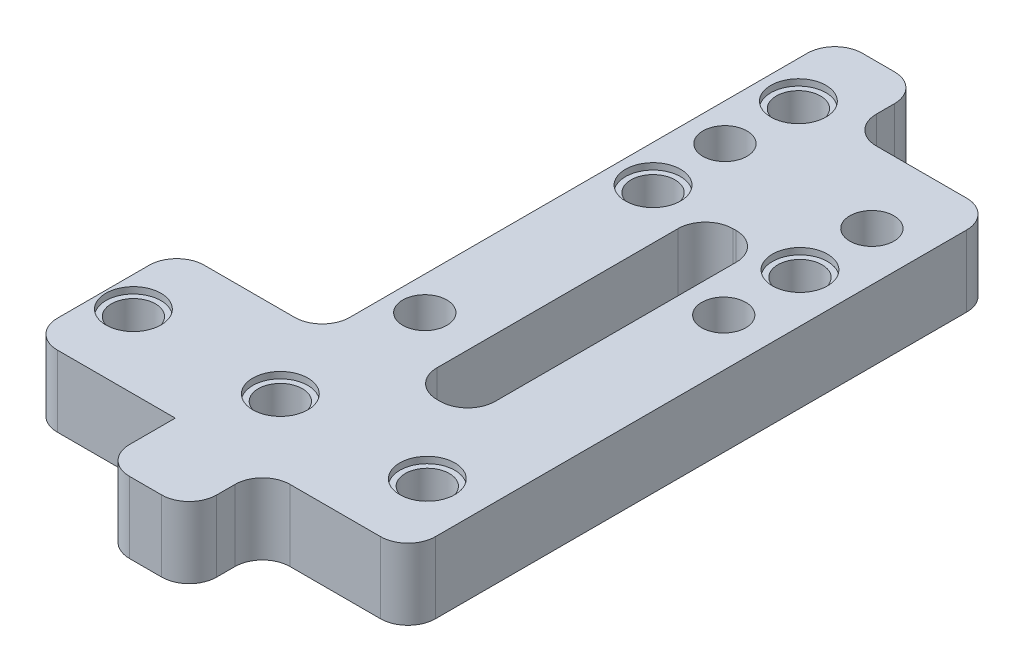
ISO-10303-21;
HEADER;
FILE_DESCRIPTION(('STEP AP214'),'2;1');
FILE_NAME('part.step','',(''),(''),'','','');
FILE_SCHEMA(('AUTOMOTIVE_DESIGN { 1 0 10303 214 1 1 1 1 }'));
ENDSEC;
DATA;
#1=APPLICATION_CONTEXT('core data for automotive mechanical design processes');
#2=APPLICATION_PROTOCOL_DEFINITION('international standard','automotive_design',2000,#1);
#3=PRODUCT_CONTEXT('',#1,'mechanical');
#4=PRODUCT('Part','Part','',(#3));
#5=PRODUCT_RELATED_PRODUCT_CATEGORY('part','',(#4));
#6=PRODUCT_DEFINITION_FORMATION('','',#4);
#7=PRODUCT_DEFINITION_CONTEXT('part definition',#1,'design');
#8=PRODUCT_DEFINITION('design','',#6,#7);
#9=PRODUCT_DEFINITION_SHAPE('','',#8);
#10=(LENGTH_UNIT() NAMED_UNIT(*) SI_UNIT(.MILLI.,.METRE.));
#11=(NAMED_UNIT(*) PLANE_ANGLE_UNIT() SI_UNIT($,.RADIAN.));
#12=(NAMED_UNIT(*) SI_UNIT($,.STERADIAN.) SOLID_ANGLE_UNIT());
#13=UNCERTAINTY_MEASURE_WITH_UNIT(LENGTH_MEASURE(1.E-05),#10,'distance_accuracy_value','');
#14=(GEOMETRIC_REPRESENTATION_CONTEXT(3) GLOBAL_UNCERTAINTY_ASSIGNED_CONTEXT((#13)) GLOBAL_UNIT_ASSIGNED_CONTEXT((#10,
#11,#12)) REPRESENTATION_CONTEXT('',''));
#15=CARTESIAN_POINT('',(0.,0.,0.));
#16=DIRECTION('',(0.,0.,1.));
#17=DIRECTION('',(1.,0.,0.));
#18=AXIS2_PLACEMENT_3D('',#15,#16,#17);
#19=CARTESIAN_POINT('',(35.882,0.,-47.98));
#20=DIRECTION('',(0.,1.,0.));
#21=DIRECTION('',(0.,0.,1.));
#22=AXIS2_PLACEMENT_3D('',#19,#20,#21);
#23=CYLINDRICAL_SURFACE('',#22,2.4);
#24=CARTESIAN_POINT('',(35.882,7.05,-47.98));
#25=DIRECTION('',(0.,1.,0.));
#26=DIRECTION('',(0.,0.,1.));
#27=AXIS2_PLACEMENT_3D('',#24,#25,#26);
#28=CIRCLE('',#27,2.4);
#29=CARTESIAN_POINT('',(35.882,7.05,-45.58));
#30=VERTEX_POINT('',#29);
#31=EDGE_CURVE('E497',#30,#30,#28,.F.);
#32=ORIENTED_EDGE('',*,*,#31,.F.);
#33=EDGE_LOOP('',(#32));
#34=FACE_BOUND('',#33,.T.);
#35=CARTESIAN_POINT('',(35.882,0.7,-47.98));
#36=DIRECTION('',(0.,-1.,0.));
#37=DIRECTION('',(0.,0.,-1.));
#38=AXIS2_PLACEMENT_3D('',#35,#36,#37);
#39=CIRCLE('',#38,2.4);
#40=CARTESIAN_POINT('',(35.882,0.7,-50.38));
#41=VERTEX_POINT('',#40);
#42=EDGE_CURVE('E42',#41,#41,#39,.F.);
#43=ORIENTED_EDGE('',*,*,#42,.F.);
#44=EDGE_LOOP('',(#43));
#45=FACE_BOUND('',#44,.T.);
#46=ADVANCED_FACE('F38',(#34,#45),#23,.F.);
#47=CARTESIAN_POINT('',(19.882,0.,-47.98));
#48=DIRECTION('',(0.,1.,0.));
#49=DIRECTION('',(0.,0.,1.));
#50=AXIS2_PLACEMENT_3D('',#47,#48,#49);
#51=CYLINDRICAL_SURFACE('',#50,2.4);
#52=CARTESIAN_POINT('',(19.882,7.05,-47.98));
#53=DIRECTION('',(0.,1.,0.));
#54=DIRECTION('',(0.,0.,1.));
#55=AXIS2_PLACEMENT_3D('',#52,#53,#54);
#56=CIRCLE('',#55,2.4);
#57=CARTESIAN_POINT('',(19.882,7.05,-45.58));
#58=VERTEX_POINT('',#57);
#59=EDGE_CURVE('E492',#58,#58,#56,.F.);
#60=ORIENTED_EDGE('',*,*,#59,.F.);
#61=EDGE_LOOP('',(#60));
#62=FACE_BOUND('',#61,.T.);
#63=CARTESIAN_POINT('',(19.882,0.7,-47.98));
#64=DIRECTION('',(0.,-1.,0.));
#65=DIRECTION('',(0.,0.,-1.));
#66=AXIS2_PLACEMENT_3D('',#63,#64,#65);
#67=CIRCLE('',#66,2.4);
#68=CARTESIAN_POINT('',(19.882,0.7,-50.38));
#69=VERTEX_POINT('',#68);
#70=EDGE_CURVE('E506',#69,#69,#67,.F.);
#71=ORIENTED_EDGE('',*,*,#70,.F.);
#72=EDGE_LOOP('',(#71));
#73=FACE_BOUND('',#72,.T.);
#74=ADVANCED_FACE('F709',(#62,#73),#51,.F.);
#75=CARTESIAN_POINT('',(19.882,0.,-63.81));
#76=DIRECTION('',(0.,1.,0.));
#77=DIRECTION('',(0.,0.,1.));
#78=AXIS2_PLACEMENT_3D('',#75,#76,#77);
#79=CYLINDRICAL_SURFACE('',#78,2.4);
#80=CARTESIAN_POINT('',(19.882,7.05,-63.81));
#81=DIRECTION('',(0.,1.,0.));
#82=DIRECTION('',(0.,0.,1.));
#83=AXIS2_PLACEMENT_3D('',#80,#81,#82);
#84=CIRCLE('',#83,2.4);
#85=CARTESIAN_POINT('',(19.882,7.05,-61.41));
#86=VERTEX_POINT('',#85);
#87=EDGE_CURVE('E487',#86,#86,#84,.F.);
#88=ORIENTED_EDGE('',*,*,#87,.F.);
#89=EDGE_LOOP('',(#88));
#90=FACE_BOUND('',#89,.T.);
#91=CARTESIAN_POINT('',(19.882,0.7,-63.81));
#92=DIRECTION('',(0.,-1.,0.));
#93=DIRECTION('',(0.,0.,-1.));
#94=AXIS2_PLACEMENT_3D('',#91,#92,#93);
#95=CIRCLE('',#94,2.4);
#96=CARTESIAN_POINT('',(19.882,0.7,-66.21));
#97=VERTEX_POINT('',#96);
#98=EDGE_CURVE('E502',#97,#97,#95,.F.);
#99=ORIENTED_EDGE('',*,*,#98,.F.);
#100=EDGE_LOOP('',(#99));
#101=FACE_BOUND('',#100,.T.);
#102=ADVANCED_FACE('F716',(#90,#101),#79,.F.);
#103=CARTESIAN_POINT('',(35.282,0.,-8.));
#104=DIRECTION('',(0.,1.,0.));
#105=DIRECTION('',(0.,0.,1.));
#106=AXIS2_PLACEMENT_3D('',#103,#104,#105);
#107=CYLINDRICAL_SURFACE('',#106,2.4);
#108=CARTESIAN_POINT('',(35.282,7.05,-8.));
#109=DIRECTION('',(0.,1.,0.));
#110=DIRECTION('',(0.,0.,1.));
#111=AXIS2_PLACEMENT_3D('',#108,#109,#110);
#112=CIRCLE('',#111,2.4);
#113=CARTESIAN_POINT('',(35.282,7.05,-5.6));
#114=VERTEX_POINT('',#113);
#115=EDGE_CURVE('E331',#114,#114,#112,.F.);
#116=ORIENTED_EDGE('',*,*,#115,.F.);
#117=EDGE_LOOP('',(#116));
#118=FACE_BOUND('',#117,.T.);
#119=CARTESIAN_POINT('',(35.282,0.7,-8.));
#120=DIRECTION('',(0.,-1.,0.));
#121=DIRECTION('',(0.,0.,-1.));
#122=AXIS2_PLACEMENT_3D('',#119,#120,#121);
#123=CIRCLE('',#122,2.4);
#124=CARTESIAN_POINT('',(35.282,0.7,-10.4));
#125=VERTEX_POINT('',#124);
#126=EDGE_CURVE('E356',#125,#125,#123,.F.);
#127=ORIENTED_EDGE('',*,*,#126,.F.);
#128=EDGE_LOOP('',(#127));
#129=FACE_BOUND('',#128,.T.);
#130=ADVANCED_FACE('F726',(#118,#129),#107,.F.);
#131=CARTESIAN_POINT('',(19.282,0.,-8.));
#132=DIRECTION('',(0.,1.,0.));
#133=DIRECTION('',(0.,0.,1.));
#134=AXIS2_PLACEMENT_3D('',#131,#132,#133);
#135=CYLINDRICAL_SURFACE('',#134,2.4);
#136=CARTESIAN_POINT('',(19.282,7.05,-8.));
#137=DIRECTION('',(0.,1.,0.));
#138=DIRECTION('',(0.,0.,1.));
#139=AXIS2_PLACEMENT_3D('',#136,#137,#138);
#140=CIRCLE('',#139,2.4);
#141=CARTESIAN_POINT('',(19.282,7.05,-5.6));
#142=VERTEX_POINT('',#141);
#143=EDGE_CURVE('E336',#142,#142,#140,.F.);
#144=ORIENTED_EDGE('',*,*,#143,.F.);
#145=EDGE_LOOP('',(#144));
#146=FACE_BOUND('',#145,.T.);
#147=CARTESIAN_POINT('',(19.282,0.7,-8.));
#148=DIRECTION('',(0.,-1.,0.));
#149=DIRECTION('',(0.,0.,-1.));
#150=AXIS2_PLACEMENT_3D('',#147,#148,#149);
#151=CIRCLE('',#150,2.4);
#152=CARTESIAN_POINT('',(19.282,0.7,-10.4));
#153=VERTEX_POINT('',#152);
#154=EDGE_CURVE('E351',#153,#153,#151,.F.);
#155=ORIENTED_EDGE('',*,*,#154,.F.);
#156=EDGE_LOOP('',(#155));
#157=FACE_BOUND('',#156,.T.);
#158=ADVANCED_FACE('F704',(#146,#157),#135,.F.);
#159=CARTESIAN_POINT('',(3.28200000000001,0.,-8.));
#160=DIRECTION('',(0.,1.,0.));
#161=DIRECTION('',(0.,0.,1.));
#162=AXIS2_PLACEMENT_3D('',#159,#160,#161);
#163=CYLINDRICAL_SURFACE('',#162,2.4);
#164=CARTESIAN_POINT('',(3.28200000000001,7.05,-8.));
#165=DIRECTION('',(0.,1.,0.));
#166=DIRECTION('',(0.,0.,1.));
#167=AXIS2_PLACEMENT_3D('',#164,#165,#166);
#168=CIRCLE('',#167,2.4);
#169=CARTESIAN_POINT('',(3.28200000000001,7.05,-5.6));
#170=VERTEX_POINT('',#169);
#171=EDGE_CURVE('E341',#170,#170,#168,.F.);
#172=ORIENTED_EDGE('',*,*,#171,.F.);
#173=EDGE_LOOP('',(#172));
#174=FACE_BOUND('',#173,.T.);
#175=CARTESIAN_POINT('',(3.28200000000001,0.7,-8.));
#176=DIRECTION('',(0.,-1.,0.));
#177=DIRECTION('',(0.,0.,-1.));
#178=AXIS2_PLACEMENT_3D('',#175,#176,#177);
#179=CIRCLE('',#178,2.4);
#180=CARTESIAN_POINT('',(3.28200000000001,0.7,-10.4));
#181=VERTEX_POINT('',#180);
#182=EDGE_CURVE('E346',#181,#181,#179,.F.);
#183=ORIENTED_EDGE('',*,*,#182,.F.);
#184=EDGE_LOOP('',(#183));
#185=FACE_BOUND('',#184,.T.);
#186=ADVANCED_FACE('F697',(#174,#185),#163,.F.);
#187=CARTESIAN_POINT('',(0.,7.75,-16.));
#188=DIRECTION('',(1.,0.,0.));
#189=DIRECTION('',(0.,0.,-1.));
#190=AXIS2_PLACEMENT_3D('',#187,#188,#189);
#191=PLANE('',#190);
#192=DIRECTION('',(0.,0.,1.));
#193=VECTOR('',#192,1.);
#194=CARTESIAN_POINT('',(0.,0.,-16.));
#195=LINE('',#194,#193);
#196=CARTESIAN_POINT('',(0.,0.,-13.));
#197=VERTEX_POINT('',#196);
#198=CARTESIAN_POINT('',(0.,0.,-3.));
#199=VERTEX_POINT('',#198);
#200=EDGE_CURVE('E298',#197,#199,#195,.T.);
#201=ORIENTED_EDGE('',*,*,#200,.T.);
#202=DIRECTION('',(0.,-1.,0.));
#203=VECTOR('',#202,1.);
#204=CARTESIAN_POINT('',(0.,7.75,-3.));
#205=LINE('',#204,#203);
#206=CARTESIAN_POINT('',(0.,7.75,-3.));
#207=VERTEX_POINT('',#206);
#208=EDGE_CURVE('E447',#199,#207,#205,.F.);
#209=ORIENTED_EDGE('',*,*,#208,.T.);
#210=DIRECTION('',(0.,0.,1.));
#211=VECTOR('',#210,1.);
#212=CARTESIAN_POINT('',(0.,7.75,-16.));
#213=LINE('',#212,#211);
#214=CARTESIAN_POINT('',(0.,7.75,-13.));
#215=VERTEX_POINT('',#214);
#216=EDGE_CURVE('E256',#215,#207,#213,.T.);
#217=ORIENTED_EDGE('',*,*,#216,.F.);
#218=DIRECTION('',(0.,-1.,0.));
#219=VECTOR('',#218,1.);
#220=CARTESIAN_POINT('',(0.,7.75,-13.));
#221=LINE('',#220,#219);
#222=EDGE_CURVE('E444',#215,#197,#221,.T.);
#223=ORIENTED_EDGE('',*,*,#222,.T.);
#224=EDGE_LOOP('',(#201,#209,#217,#223));
#225=FACE_BOUND('',#224,.T.);
#226=ADVANCED_FACE('F695',(#225),#191,.F.);
#227=CARTESIAN_POINT('',(0.,7.75,0.));
#228=DIRECTION('',(0.,0.,-1.));
#229=DIRECTION('',(-1.,0.,0.));
#230=AXIS2_PLACEMENT_3D('',#227,#228,#229);
#231=PLANE('',#230);
#232=DIRECTION('',(1.,0.,0.));
#233=VECTOR('',#232,1.);
#234=CARTESIAN_POINT('',(0.,7.75,0.));
#235=LINE('',#234,#233);
#236=CARTESIAN_POINT('',(3.,7.75,0.));
#237=VERTEX_POINT('',#236);
#238=CARTESIAN_POINT('',(15.841,7.75,0.));
#239=VERTEX_POINT('',#238);
#240=EDGE_CURVE('E243',#237,#239,#235,.T.);
#241=ORIENTED_EDGE('',*,*,#240,.F.);
#242=DIRECTION('',(0.,-1.,0.));
#243=VECTOR('',#242,1.);
#244=CARTESIAN_POINT('',(3.,7.75,0.));
#245=LINE('',#244,#243);
#246=CARTESIAN_POINT('',(3.,0.,0.));
#247=VERTEX_POINT('',#246);
#248=EDGE_CURVE('E442',#237,#247,#245,.T.);
#249=ORIENTED_EDGE('',*,*,#248,.T.);
#250=DIRECTION('',(1.,0.,0.));
#251=VECTOR('',#250,1.);
#252=CARTESIAN_POINT('',(0.,0.,0.));
#253=LINE('',#252,#251);
#254=CARTESIAN_POINT('',(15.841,0.,0.));
#255=VERTEX_POINT('',#254);
#256=EDGE_CURVE('E262',#247,#255,#253,.T.);
#257=ORIENTED_EDGE('',*,*,#256,.T.);
#258=DIRECTION('',(0.,-1.,0.));
#259=VECTOR('',#258,1.);
#260=CARTESIAN_POINT('',(15.841,7.75,0.));
#261=LINE('',#260,#259);
#262=EDGE_CURVE('E259',#239,#255,#261,.T.);
#263=ORIENTED_EDGE('',*,*,#262,.F.);
#264=EDGE_LOOP('',(#241,#249,#257,#263));
#265=FACE_BOUND('',#264,.T.);
#266=ADVANCED_FACE('F260',(#265),#231,.F.);
#267=CARTESIAN_POINT('',(15.841,7.75,0.));
#268=DIRECTION('',(1.,0.,0.));
#269=DIRECTION('',(0.,0.,-1.));
#270=AXIS2_PLACEMENT_3D('',#267,#268,#269);
#271=PLANE('',#270);
#272=DIRECTION('',(0.,0.,1.));
#273=VECTOR('',#272,1.);
#274=CARTESIAN_POINT('',(15.841,0.,0.));
#275=LINE('',#274,#273);
#276=CARTESIAN_POINT('',(15.841,0.,4.985));
#277=VERTEX_POINT('',#276);
#278=EDGE_CURVE('E303',#255,#277,#275,.T.);
#279=ORIENTED_EDGE('',*,*,#278,.T.);
#280=DIRECTION('',(0.,-1.,0.));
#281=VECTOR('',#280,1.);
#282=CARTESIAN_POINT('',(15.841,7.75,4.985));
#283=LINE('',#282,#281);
#284=CARTESIAN_POINT('',(15.841,7.75,4.985));
#285=VERTEX_POINT('',#284);
#286=EDGE_CURVE('E271',#277,#285,#283,.F.);
#287=ORIENTED_EDGE('',*,*,#286,.T.);
#288=DIRECTION('',(0.,0.,1.));
#289=VECTOR('',#288,1.);
#290=CARTESIAN_POINT('',(15.841,7.75,0.));
#291=LINE('',#290,#289);
#292=EDGE_CURVE('E248',#239,#285,#291,.T.);
#293=ORIENTED_EDGE('',*,*,#292,.F.);
#294=ORIENTED_EDGE('',*,*,#262,.T.);
#295=EDGE_LOOP('',(#279,#287,#293,#294));
#296=FACE_BOUND('',#295,.T.);
#297=ADVANCED_FACE('F269',(#296),#271,.F.);
#298=CARTESIAN_POINT('',(15.841,7.75,7.985));
#299=DIRECTION('',(0.,0.,-1.));
#300=DIRECTION('',(-1.,0.,0.));
#301=AXIS2_PLACEMENT_3D('',#298,#299,#300);
#302=PLANE('',#301);
#303=DIRECTION('',(1.,0.,0.));
#304=VECTOR('',#303,1.);
#305=CARTESIAN_POINT('',(15.841,0.,7.985));
#306=LINE('',#305,#304);
#307=CARTESIAN_POINT('',(18.841,0.,7.985));
#308=VERTEX_POINT('',#307);
#309=CARTESIAN_POINT('',(22.341,0.,7.985));
#310=VERTEX_POINT('',#309);
#311=EDGE_CURVE('E305',#308,#310,#306,.T.);
#312=ORIENTED_EDGE('',*,*,#311,.T.);
#313=DIRECTION('',(0.,-1.,0.));
#314=VECTOR('',#313,1.);
#315=CARTESIAN_POINT('',(22.341,7.75,7.985));
#316=LINE('',#315,#314);
#317=CARTESIAN_POINT('',(22.341,7.75,7.985));
#318=VERTEX_POINT('',#317);
#319=EDGE_CURVE('E439',#310,#318,#316,.F.);
#320=ORIENTED_EDGE('',*,*,#319,.T.);
#321=DIRECTION('',(1.,0.,0.));
#322=VECTOR('',#321,1.);
#323=CARTESIAN_POINT('',(15.841,7.75,7.985));
#324=LINE('',#323,#322);
#325=CARTESIAN_POINT('',(18.841,7.75,7.985));
#326=VERTEX_POINT('',#325);
#327=EDGE_CURVE('E272',#326,#318,#324,.T.);
#328=ORIENTED_EDGE('',*,*,#327,.F.);
#329=DIRECTION('',(0.,-1.,0.));
#330=VECTOR('',#329,1.);
#331=CARTESIAN_POINT('',(18.841,7.75,7.985));
#332=LINE('',#331,#330);
#333=EDGE_CURVE('E436',#326,#308,#332,.T.);
#334=ORIENTED_EDGE('',*,*,#333,.T.);
#335=EDGE_LOOP('',(#312,#320,#328,#334));
#336=FACE_BOUND('',#335,.T.);
#337=ADVANCED_FACE('F626',(#336),#302,.F.);
#338=CARTESIAN_POINT('',(25.341,7.75,7.985));
#339=DIRECTION('',(-1.,0.,0.));
#340=DIRECTION('',(0.,0.,1.));
#341=AXIS2_PLACEMENT_3D('',#338,#339,#340);
#342=PLANE('',#341);
#343=DIRECTION('',(0.,0.,-1.));
#344=VECTOR('',#343,1.);
#345=CARTESIAN_POINT('',(25.341,0.,7.985));
#346=LINE('',#345,#344);
#347=CARTESIAN_POINT('',(25.341,0.,4.985));
#348=VERTEX_POINT('',#347);
#349=CARTESIAN_POINT('',(25.341,0.,3.));
#350=VERTEX_POINT('',#349);
#351=EDGE_CURVE('E308',#348,#350,#346,.T.);
#352=ORIENTED_EDGE('',*,*,#351,.T.);
#353=DIRECTION('',(0.,-1.,0.));
#354=VECTOR('',#353,1.);
#355=CARTESIAN_POINT('',(25.341,7.75,3.));
#356=LINE('',#355,#354);
#357=CARTESIAN_POINT('',(25.341,7.75,3.));
#358=VERTEX_POINT('',#357);
#359=EDGE_CURVE('E434',#350,#358,#356,.F.);
#360=ORIENTED_EDGE('',*,*,#359,.T.);
#361=DIRECTION('',(0.,0.,-1.));
#362=VECTOR('',#361,1.);
#363=CARTESIAN_POINT('',(25.341,7.75,7.985));
#364=LINE('',#363,#362);
#365=CARTESIAN_POINT('',(25.341,7.75,4.985));
#366=VERTEX_POINT('',#365);
#367=EDGE_CURVE('E275',#366,#358,#364,.T.);
#368=ORIENTED_EDGE('',*,*,#367,.F.);
#369=DIRECTION('',(0.,-1.,0.));
#370=VECTOR('',#369,1.);
#371=CARTESIAN_POINT('',(25.341,7.75,4.985));
#372=LINE('',#371,#370);
#373=EDGE_CURVE('E431',#366,#348,#372,.T.);
#374=ORIENTED_EDGE('',*,*,#373,.T.);
#375=EDGE_LOOP('',(#352,#360,#368,#374));
#376=FACE_BOUND('',#375,.T.);
#377=ADVANCED_FACE('F634',(#376),#342,.F.);
#378=CARTESIAN_POINT('',(25.341,7.75,0.));
#379=DIRECTION('',(0.,0.,-1.));
#380=DIRECTION('',(-1.,0.,0.));
#381=AXIS2_PLACEMENT_3D('',#378,#379,#380);
#382=PLANE('',#381);
#383=DIRECTION('',(1.,0.,0.));
#384=VECTOR('',#383,1.);
#385=CARTESIAN_POINT('',(25.341,0.,0.));
#386=LINE('',#385,#384);
#387=CARTESIAN_POINT('',(28.341,0.,0.));
#388=VERTEX_POINT('',#387);
#389=CARTESIAN_POINT('',(38.182,0.,0.));
#390=VERTEX_POINT('',#389);
#391=EDGE_CURVE('E311',#388,#390,#386,.T.);
#392=ORIENTED_EDGE('',*,*,#391,.T.);
#393=DIRECTION('',(0.,-1.,0.));
#394=VECTOR('',#393,1.);
#395=CARTESIAN_POINT('',(38.182,7.75,0.));
#396=LINE('',#395,#394);
#397=CARTESIAN_POINT('',(38.182,7.75,0.));
#398=VERTEX_POINT('',#397);
#399=EDGE_CURVE('E384',#390,#398,#396,.F.);
#400=ORIENTED_EDGE('',*,*,#399,.T.);
#401=DIRECTION('',(1.,0.,0.));
#402=VECTOR('',#401,1.);
#403=CARTESIAN_POINT('',(25.341,7.75,0.));
#404=LINE('',#403,#402);
#405=CARTESIAN_POINT('',(28.341,7.75,0.));
#406=VERTEX_POINT('',#405);
#407=EDGE_CURVE('E281',#406,#398,#404,.T.);
#408=ORIENTED_EDGE('',*,*,#407,.F.);
#409=DIRECTION('',(0.,-1.,0.));
#410=VECTOR('',#409,1.);
#411=CARTESIAN_POINT('',(28.341,0.,0.));
#412=LINE('',#411,#410);
#413=EDGE_CURVE('E381',#406,#388,#412,.T.);
#414=ORIENTED_EDGE('',*,*,#413,.T.);
#415=EDGE_LOOP('',(#392,#400,#408,#414));
#416=FACE_BOUND('',#415,.T.);
#417=ADVANCED_FACE('F643',(#416),#382,.F.);
#418=CARTESIAN_POINT('',(41.182,7.75,0.));
#419=DIRECTION('',(-1.,0.,0.));
#420=DIRECTION('',(0.,0.,1.));
#421=AXIS2_PLACEMENT_3D('',#418,#419,#420);
#422=PLANE('',#421);
#423=DIRECTION('',(0.,0.,-1.));
#424=VECTOR('',#423,1.);
#425=CARTESIAN_POINT('',(41.182,7.75,0.));
#426=LINE('',#425,#424);
#427=CARTESIAN_POINT('',(41.182,7.75,-3.));
#428=VERTEX_POINT('',#427);
#429=CARTESIAN_POINT('',(41.182,7.75,-60.83));
#430=VERTEX_POINT('',#429);
#431=EDGE_CURVE('E283',#428,#430,#426,.T.);
#432=ORIENTED_EDGE('',*,*,#431,.F.);
#433=DIRECTION('',(0.,-1.,0.));
#434=VECTOR('',#433,1.);
#435=CARTESIAN_POINT('',(41.182,7.75,-3.));
#436=LINE('',#435,#434);
#437=CARTESIAN_POINT('',(41.182,0.,-3.));
#438=VERTEX_POINT('',#437);
#439=EDGE_CURVE('E362',#428,#438,#436,.T.);
#440=ORIENTED_EDGE('',*,*,#439,.T.);
#441=DIRECTION('',(0.,0.,-1.));
#442=VECTOR('',#441,1.);
#443=CARTESIAN_POINT('',(41.182,0.,0.));
#444=LINE('',#443,#442);
#445=CARTESIAN_POINT('',(41.182,0.,-60.83));
#446=VERTEX_POINT('',#445);
#447=EDGE_CURVE('E314',#438,#446,#444,.T.);
#448=ORIENTED_EDGE('',*,*,#447,.T.);
#449=DIRECTION('',(0.,-1.,0.));
#450=VECTOR('',#449,1.);
#451=CARTESIAN_POINT('',(41.182,7.75,-60.83));
#452=LINE('',#451,#450);
#453=EDGE_CURVE('E266',#446,#430,#452,.F.);
#454=ORIENTED_EDGE('',*,*,#453,.T.);
#455=EDGE_LOOP('',(#432,#440,#448,#454));
#456=FACE_BOUND('',#455,.T.);
#457=ADVANCED_FACE('F652',(#456),#422,.F.);
#458=CARTESIAN_POINT('',(41.182,7.75,-63.83));
#459=DIRECTION('',(0.,0.,1.));
#460=DIRECTION('',(1.,0.,0.));
#461=AXIS2_PLACEMENT_3D('',#458,#459,#460);
#462=PLANE('',#461);
#463=DIRECTION('',(-1.,0.,0.));
#464=VECTOR('',#463,1.);
#465=CARTESIAN_POINT('',(41.182,7.75,-63.83));
#466=LINE('',#465,#464);
#467=CARTESIAN_POINT('',(38.182,7.75,-63.83));
#468=VERTEX_POINT('',#467);
#469=CARTESIAN_POINT('',(28.341,7.75,-63.83));
#470=VERTEX_POINT('',#469);
#471=EDGE_CURVE('E286',#468,#470,#466,.T.);
#472=ORIENTED_EDGE('',*,*,#471,.F.);
#473=DIRECTION('',(0.,-1.,0.));
#474=VECTOR('',#473,1.);
#475=CARTESIAN_POINT('',(38.182,7.75,-63.83));
#476=LINE('',#475,#474);
#477=CARTESIAN_POINT('',(38.182,0.,-63.83));
#478=VERTEX_POINT('',#477);
#479=EDGE_CURVE('E403',#468,#478,#476,.T.);
#480=ORIENTED_EDGE('',*,*,#479,.T.);
#481=DIRECTION('',(-1.,0.,0.));
#482=VECTOR('',#481,1.);
#483=CARTESIAN_POINT('',(41.182,0.,-63.83));
#484=LINE('',#483,#482);
#485=CARTESIAN_POINT('',(28.341,0.,-63.83));
#486=VERTEX_POINT('',#485);
#487=EDGE_CURVE('E317',#478,#486,#484,.T.);
#488=ORIENTED_EDGE('',*,*,#487,.T.);
#489=DIRECTION('',(0.,-1.,0.));
#490=VECTOR('',#489,1.);
#491=CARTESIAN_POINT('',(28.341,7.75,-63.83));
#492=LINE('',#491,#490);
#493=EDGE_CURVE('E401',#486,#470,#492,.F.);
#494=ORIENTED_EDGE('',*,*,#493,.T.);
#495=EDGE_LOOP('',(#472,#480,#488,#494));
#496=FACE_BOUND('',#495,.T.);
#497=ADVANCED_FACE('F660',(#496),#462,.F.);
#498=CARTESIAN_POINT('',(25.341,7.75,-63.83));
#499=DIRECTION('',(-1.,0.,0.));
#500=DIRECTION('',(0.,0.,1.));
#501=AXIS2_PLACEMENT_3D('',#498,#499,#500);
#502=PLANE('',#501);
#503=DIRECTION('',(0.,0.,-1.));
#504=VECTOR('',#503,1.);
#505=CARTESIAN_POINT('',(25.341,7.75,-63.83));
#506=LINE('',#505,#504);
#507=CARTESIAN_POINT('',(25.341,7.75,-66.83));
#508=VERTEX_POINT('',#507);
#509=CARTESIAN_POINT('',(25.341,7.75,-68.815));
#510=VERTEX_POINT('',#509);
#511=EDGE_CURVE('E289',#508,#510,#506,.T.);
#512=ORIENTED_EDGE('',*,*,#511,.F.);
#513=DIRECTION('',(0.,-1.,0.));
#514=VECTOR('',#513,1.);
#515=CARTESIAN_POINT('',(25.341,0.,-66.83));
#516=LINE('',#515,#514);
#517=CARTESIAN_POINT('',(25.341,0.,-66.83));
#518=VERTEX_POINT('',#517);
#519=EDGE_CURVE('E408',#508,#518,#516,.T.);
#520=ORIENTED_EDGE('',*,*,#519,.T.);
#521=DIRECTION('',(0.,0.,-1.));
#522=VECTOR('',#521,1.);
#523=CARTESIAN_POINT('',(25.341,0.,-63.83));
#524=LINE('',#523,#522);
#525=CARTESIAN_POINT('',(25.341,0.,-68.815));
#526=VERTEX_POINT('',#525);
#527=EDGE_CURVE('E320',#518,#526,#524,.T.);
#528=ORIENTED_EDGE('',*,*,#527,.T.);
#529=DIRECTION('',(0.,-1.,0.));
#530=VECTOR('',#529,1.);
#531=CARTESIAN_POINT('',(25.341,7.75,-68.815));
#532=LINE('',#531,#530);
#533=EDGE_CURVE('E406',#526,#510,#532,.F.);
#534=ORIENTED_EDGE('',*,*,#533,.T.);
#535=EDGE_LOOP('',(#512,#520,#528,#534));
#536=FACE_BOUND('',#535,.T.);
#537=ADVANCED_FACE('F669',(#536),#502,.F.);
#538=CARTESIAN_POINT('',(25.341,7.75,-71.815));
#539=DIRECTION('',(0.,0.,1.));
#540=DIRECTION('',(1.,0.,0.));
#541=AXIS2_PLACEMENT_3D('',#538,#539,#540);
#542=PLANE('',#541);
#543=DIRECTION('',(-1.,0.,0.));
#544=VECTOR('',#543,1.);
#545=CARTESIAN_POINT('',(25.341,7.75,-71.815));
#546=LINE('',#545,#544);
#547=CARTESIAN_POINT('',(22.341,7.75,-71.815));
#548=VERTEX_POINT('',#547);
#549=CARTESIAN_POINT('',(18.841,7.75,-71.815));
#550=VERTEX_POINT('',#549);
#551=EDGE_CURVE('E292',#548,#550,#546,.T.);
#552=ORIENTED_EDGE('',*,*,#551,.F.);
#553=DIRECTION('',(0.,-1.,0.));
#554=VECTOR('',#553,1.);
#555=CARTESIAN_POINT('',(22.341,7.75,-71.815));
#556=LINE('',#555,#554);
#557=CARTESIAN_POINT('',(22.341,0.,-71.815));
#558=VERTEX_POINT('',#557);
#559=EDGE_CURVE('E460',#548,#558,#556,.T.);
#560=ORIENTED_EDGE('',*,*,#559,.T.);
#561=DIRECTION('',(-1.,0.,0.));
#562=VECTOR('',#561,1.);
#563=CARTESIAN_POINT('',(25.341,0.,-71.815));
#564=LINE('',#563,#562);
#565=CARTESIAN_POINT('',(18.841,0.,-71.815));
#566=VERTEX_POINT('',#565);
#567=EDGE_CURVE('E323',#558,#566,#564,.T.);
#568=ORIENTED_EDGE('',*,*,#567,.T.);
#569=DIRECTION('',(0.,-1.,0.));
#570=VECTOR('',#569,1.);
#571=CARTESIAN_POINT('',(18.841,7.75,-71.815));
#572=LINE('',#571,#570);
#573=EDGE_CURVE('E458',#566,#550,#572,.F.);
#574=ORIENTED_EDGE('',*,*,#573,.T.);
#575=EDGE_LOOP('',(#552,#560,#568,#574));
#576=FACE_BOUND('',#575,.T.);
#577=ADVANCED_FACE('F678',(#576),#542,.F.);
#578=CARTESIAN_POINT('',(15.841,7.75,-71.815));
#579=DIRECTION('',(1.,0.,0.));
#580=DIRECTION('',(0.,0.,-1.));
#581=AXIS2_PLACEMENT_3D('',#578,#579,#580);
#582=PLANE('',#581);
#583=DIRECTION('',(0.,0.,1.));
#584=VECTOR('',#583,1.);
#585=CARTESIAN_POINT('',(15.841,0.,-71.815));
#586=LINE('',#585,#584);
#587=CARTESIAN_POINT('',(15.841,0.,-68.815));
#588=VERTEX_POINT('',#587);
#589=CARTESIAN_POINT('',(15.841,0.,-19.));
#590=VERTEX_POINT('',#589);
#591=EDGE_CURVE('E326',#588,#590,#586,.T.);
#592=ORIENTED_EDGE('',*,*,#591,.T.);
#593=DIRECTION('',(0.,-1.,0.));
#594=VECTOR('',#593,1.);
#595=CARTESIAN_POINT('',(15.841,7.75,-19.));
#596=LINE('',#595,#594);
#597=CARTESIAN_POINT('',(15.841,7.75,-19.));
#598=VERTEX_POINT('',#597);
#599=EDGE_CURVE('E456',#590,#598,#596,.F.);
#600=ORIENTED_EDGE('',*,*,#599,.T.);
#601=DIRECTION('',(0.,0.,1.));
#602=VECTOR('',#601,1.);
#603=CARTESIAN_POINT('',(15.841,7.75,-71.815));
#604=LINE('',#603,#602);
#605=CARTESIAN_POINT('',(15.841,7.75,-68.815));
#606=VERTEX_POINT('',#605);
#607=EDGE_CURVE('E295',#606,#598,#604,.T.);
#608=ORIENTED_EDGE('',*,*,#607,.F.);
#609=DIRECTION('',(0.,-1.,0.));
#610=VECTOR('',#609,1.);
#611=CARTESIAN_POINT('',(15.841,7.75,-68.815));
#612=LINE('',#611,#610);
#613=EDGE_CURVE('E453',#606,#588,#612,.T.);
#614=ORIENTED_EDGE('',*,*,#613,.T.);
#615=EDGE_LOOP('',(#592,#600,#608,#614));
#616=FACE_BOUND('',#615,.T.);
#617=ADVANCED_FACE('F685',(#616),#582,.F.);
#618=CARTESIAN_POINT('',(15.841,7.75,-16.));
#619=DIRECTION('',(0.,0.,1.));
#620=DIRECTION('',(1.,0.,0.));
#621=AXIS2_PLACEMENT_3D('',#618,#619,#620);
#622=PLANE('',#621);
#623=DIRECTION('',(-1.,0.,0.));
#624=VECTOR('',#623,1.);
#625=CARTESIAN_POINT('',(15.841,0.,-16.));
#626=LINE('',#625,#624);
#627=CARTESIAN_POINT('',(12.841,0.,-16.));
#628=VERTEX_POINT('',#627);
#629=CARTESIAN_POINT('',(3.,0.,-16.));
#630=VERTEX_POINT('',#629);
#631=EDGE_CURVE('E329',#628,#630,#626,.T.);
#632=ORIENTED_EDGE('',*,*,#631,.T.);
#633=DIRECTION('',(0.,-1.,0.));
#634=VECTOR('',#633,1.);
#635=CARTESIAN_POINT('',(3.,7.75,-16.));
#636=LINE('',#635,#634);
#637=CARTESIAN_POINT('',(3.,7.75,-16.));
#638=VERTEX_POINT('',#637);
#639=EDGE_CURVE('E55',#630,#638,#636,.F.);
#640=ORIENTED_EDGE('',*,*,#639,.T.);
#641=DIRECTION('',(-1.,0.,0.));
#642=VECTOR('',#641,1.);
#643=CARTESIAN_POINT('',(15.841,7.75,-16.));
#644=LINE('',#643,#642);
#645=CARTESIAN_POINT('',(12.841,7.75,-16.));
#646=VERTEX_POINT('',#645);
#647=EDGE_CURVE('E267',#646,#638,#644,.T.);
#648=ORIENTED_EDGE('',*,*,#647,.F.);
#649=DIRECTION('',(0.,-1.,0.));
#650=VECTOR('',#649,1.);
#651=CARTESIAN_POINT('',(12.841,0.,-16.));
#652=LINE('',#651,#650);
#653=EDGE_CURVE('E449',#646,#628,#652,.T.);
#654=ORIENTED_EDGE('',*,*,#653,.T.);
#655=EDGE_LOOP('',(#632,#640,#648,#654));
#656=FACE_BOUND('',#655,.T.);
#657=ADVANCED_FACE('F692',(#656),#622,.F.);
#658=CARTESIAN_POINT('',(0.,7.75,0.));
#659=DIRECTION('',(0.,1.,0.));
#660=DIRECTION('',(0.,0.,1.));
#661=AXIS2_PLACEMENT_3D('',#658,#659,#660);
#662=PLANE('',#661);
#663=CARTESIAN_POINT('',(35.882,7.75,-47.98));
#664=DIRECTION('',(0.,1.,0.));
#665=DIRECTION('',(0.,0.,1.));
#666=AXIS2_PLACEMENT_3D('',#663,#664,#665);
#667=CIRCLE('',#666,3.);
#668=CARTESIAN_POINT('',(35.882,7.75,-44.98));
#669=VERTEX_POINT('',#668);
#670=EDGE_CURVE('E504',#669,#669,#667,.T.);
#671=ORIENTED_EDGE('',*,*,#670,.F.);
#672=EDGE_LOOP('',(#671));
#673=FACE_BOUND('',#672,.T.);
#674=CARTESIAN_POINT('',(19.882,7.75,-47.98));
#675=DIRECTION('',(0.,1.,0.));
#676=DIRECTION('',(0.,0.,1.));
#677=AXIS2_PLACEMENT_3D('',#674,#675,#676);
#678=CIRCLE('',#677,3.);
#679=CARTESIAN_POINT('',(19.882,7.75,-44.98));
#680=VERTEX_POINT('',#679);
#681=EDGE_CURVE('E500',#680,#680,#678,.T.);
#682=ORIENTED_EDGE('',*,*,#681,.F.);
#683=EDGE_LOOP('',(#682));
#684=FACE_BOUND('',#683,.T.);
#685=CARTESIAN_POINT('',(19.882,7.75,-63.81));
#686=DIRECTION('',(0.,1.,0.));
#687=DIRECTION('',(0.,0.,1.));
#688=AXIS2_PLACEMENT_3D('',#685,#686,#687);
#689=CIRCLE('',#688,3.);
#690=CARTESIAN_POINT('',(19.882,7.75,-60.81));
#691=VERTEX_POINT('',#690);
#692=EDGE_CURVE('E495',#691,#691,#689,.T.);
#693=ORIENTED_EDGE('',*,*,#692,.F.);
#694=EDGE_LOOP('',(#693));
#695=FACE_BOUND('',#694,.T.);
#696=CARTESIAN_POINT('',(35.982,7.75,-39.58));
#697=DIRECTION('',(0.,1.,0.));
#698=DIRECTION('',(0.,0.,1.));
#699=AXIS2_PLACEMENT_3D('',#696,#697,#698);
#700=CIRCLE('',#699,2.4);
#701=CARTESIAN_POINT('',(35.982,7.75,-37.18));
#702=VERTEX_POINT('',#701);
#703=EDGE_CURVE('E490',#702,#702,#700,.T.);
#704=ORIENTED_EDGE('',*,*,#703,.F.);
#705=EDGE_LOOP('',(#704));
#706=FACE_BOUND('',#705,.T.);
#707=CARTESIAN_POINT('',(19.482,7.75,-23.53));
#708=DIRECTION('',(0.,1.,0.));
#709=DIRECTION('',(0.,0.,1.));
#710=AXIS2_PLACEMENT_3D('',#707,#708,#709);
#711=CIRCLE('',#710,2.4);
#712=CARTESIAN_POINT('',(19.482,7.75,-21.13));
#713=VERTEX_POINT('',#712);
#714=EDGE_CURVE('E542',#713,#713,#711,.T.);
#715=ORIENTED_EDGE('',*,*,#714,.F.);
#716=EDGE_LOOP('',(#715));
#717=FACE_BOUND('',#716,.T.);
#718=CARTESIAN_POINT('',(3.28200000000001,7.75,-8.));
#719=DIRECTION('',(0.,1.,0.));
#720=DIRECTION('',(0.,0.,1.));
#721=AXIS2_PLACEMENT_3D('',#718,#719,#720);
#722=CIRCLE('',#721,3.);
#723=CARTESIAN_POINT('',(3.28200000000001,7.75,-5.));
#724=VERTEX_POINT('',#723);
#725=EDGE_CURVE('E349',#724,#724,#722,.T.);
#726=ORIENTED_EDGE('',*,*,#725,.F.);
#727=EDGE_LOOP('',(#726));
#728=FACE_BOUND('',#727,.T.);
#729=CARTESIAN_POINT('',(19.282,7.75,-8.));
#730=DIRECTION('',(0.,1.,0.));
#731=DIRECTION('',(0.,0.,1.));
#732=AXIS2_PLACEMENT_3D('',#729,#730,#731);
#733=CIRCLE('',#732,3.);
#734=CARTESIAN_POINT('',(19.282,7.75,-5.));
#735=VERTEX_POINT('',#734);
#736=EDGE_CURVE('E344',#735,#735,#733,.T.);
#737=ORIENTED_EDGE('',*,*,#736,.F.);
#738=EDGE_LOOP('',(#737));
#739=FACE_BOUND('',#738,.T.);
#740=CARTESIAN_POINT('',(35.282,7.75,-8.));
#741=DIRECTION('',(0.,1.,0.));
#742=DIRECTION('',(0.,0.,1.));
#743=AXIS2_PLACEMENT_3D('',#740,#741,#742);
#744=CIRCLE('',#743,3.);
#745=CARTESIAN_POINT('',(35.282,7.75,-5.));
#746=VERTEX_POINT('',#745);
#747=EDGE_CURVE('E339',#746,#746,#744,.T.);
#748=ORIENTED_EDGE('',*,*,#747,.F.);
#749=EDGE_LOOP('',(#748));
#750=FACE_BOUND('',#749,.T.);
#751=CARTESIAN_POINT('',(35.882,7.75,-55.81));
#752=DIRECTION('',(0.,1.,0.));
#753=DIRECTION('',(0.,0.,1.));
#754=AXIS2_PLACEMENT_3D('',#751,#752,#753);
#755=CIRCLE('',#754,2.4);
#756=CARTESIAN_POINT('',(35.882,7.75,-53.41));
#757=VERTEX_POINT('',#756);
#758=EDGE_CURVE('E334',#757,#757,#755,.T.);
#759=ORIENTED_EDGE('',*,*,#758,.F.);
#760=EDGE_LOOP('',(#759));
#761=FACE_BOUND('',#760,.T.);
#762=CARTESIAN_POINT('',(19.882,7.75,-55.81));
#763=DIRECTION('',(0.,1.,0.));
#764=DIRECTION('',(0.,0.,1.));
#765=AXIS2_PLACEMENT_3D('',#762,#763,#764);
#766=CIRCLE('',#765,2.4);
#767=CARTESIAN_POINT('',(19.882,7.75,-53.41));
#768=VERTEX_POINT('',#767);
#769=EDGE_CURVE('E578',#768,#768,#766,.T.);
#770=ORIENTED_EDGE('',*,*,#769,.F.);
#771=EDGE_LOOP('',(#770));
#772=FACE_BOUND('',#771,.T.);
#773=DIRECTION('',(0.,0.,1.));
#774=VECTOR('',#773,1.);
#775=CARTESIAN_POINT('',(25.341,7.75,-48.23));
#776=LINE('',#775,#774);
#777=CARTESIAN_POINT('',(25.341,7.75,-45.23));
#778=VERTEX_POINT('',#777);
#779=CARTESIAN_POINT('',(25.341,7.75,-19.));
#780=VERTEX_POINT('',#779);
#781=EDGE_CURVE('E584',#778,#780,#776,.T.);
#782=ORIENTED_EDGE('',*,*,#781,.F.);
#783=CARTESIAN_POINT('',(28.341,7.75,-45.23));
#784=DIRECTION('',(0.,1.,0.));
#785=DIRECTION('',(0.,0.,1.));
#786=AXIS2_PLACEMENT_3D('',#783,#784,#785);
#787=CIRCLE('',#786,3.);
#788=CARTESIAN_POINT('',(28.341,7.75,-48.23));
#789=VERTEX_POINT('',#788);
#790=EDGE_CURVE('E471',#778,#789,#787,.F.);
#791=ORIENTED_EDGE('',*,*,#790,.T.);
#792=DIRECTION('',(-1.,0.,0.));
#793=VECTOR('',#792,1.);
#794=CARTESIAN_POINT('',(25.341,7.75,-48.23));
#795=LINE('',#794,#793);
#796=CARTESIAN_POINT('',(28.681,7.75,-48.23));
#797=VERTEX_POINT('',#796);
#798=EDGE_CURVE('E591',#797,#789,#795,.T.);
#799=ORIENTED_EDGE('',*,*,#798,.F.);
#800=CARTESIAN_POINT('',(28.681,7.75,-45.23));
#801=DIRECTION('',(0.,1.,0.));
#802=DIRECTION('',(0.,0.,1.));
#803=AXIS2_PLACEMENT_3D('',#800,#801,#802);
#804=CIRCLE('',#803,3.);
#805=CARTESIAN_POINT('',(31.681,7.75,-45.23));
#806=VERTEX_POINT('',#805);
#807=EDGE_CURVE('E467',#797,#806,#804,.F.);
#808=ORIENTED_EDGE('',*,*,#807,.T.);
#809=DIRECTION('',(0.,0.,-1.));
#810=VECTOR('',#809,1.);
#811=CARTESIAN_POINT('',(31.681,7.75,-48.23));
#812=LINE('',#811,#810);
#813=CARTESIAN_POINT('',(31.681,7.75,-19.));
#814=VERTEX_POINT('',#813);
#815=EDGE_CURVE('E604',#814,#806,#812,.T.);
#816=ORIENTED_EDGE('',*,*,#815,.F.);
#817=CARTESIAN_POINT('',(28.681,7.75,-19.));
#818=DIRECTION('',(0.,1.,0.));
#819=DIRECTION('',(0.,0.,1.));
#820=AXIS2_PLACEMENT_3D('',#817,#818,#819);
#821=CIRCLE('',#820,3.);
#822=CARTESIAN_POINT('',(28.681,7.75,-16.));
#823=VERTEX_POINT('',#822);
#824=EDGE_CURVE('E47',#814,#823,#821,.F.);
#825=ORIENTED_EDGE('',*,*,#824,.T.);
#826=DIRECTION('',(1.,0.,0.));
#827=VECTOR('',#826,1.);
#828=CARTESIAN_POINT('',(31.681,7.75,-16.));
#829=LINE('',#828,#827);
#830=CARTESIAN_POINT('',(28.341,7.75,-16.));
#831=VERTEX_POINT('',#830);
#832=EDGE_CURVE('E601',#831,#823,#829,.T.);
#833=ORIENTED_EDGE('',*,*,#832,.F.);
#834=CARTESIAN_POINT('',(28.341,7.75,-19.));
#835=DIRECTION('',(0.,1.,0.));
#836=DIRECTION('',(0.,0.,1.));
#837=AXIS2_PLACEMENT_3D('',#834,#835,#836);
#838=CIRCLE('',#837,3.);
#839=EDGE_CURVE('E475',#831,#780,#838,.F.);
#840=ORIENTED_EDGE('',*,*,#839,.T.);
#841=EDGE_LOOP('',(#782,#791,#799,#808,#816,#825,#833,#840));
#842=FACE_BOUND('',#841,.T.);
#843=ORIENTED_EDGE('',*,*,#407,.T.);
#844=CARTESIAN_POINT('',(38.182,7.75,-3.));
#845=DIRECTION('',(0.,1.,0.));
#846=DIRECTION('',(0.,0.,1.));
#847=AXIS2_PLACEMENT_3D('',#844,#845,#846);
#848=CIRCLE('',#847,3.);
#849=EDGE_CURVE('E399',#398,#428,#848,.T.);
#850=ORIENTED_EDGE('',*,*,#849,.T.);
#851=ORIENTED_EDGE('',*,*,#431,.T.);
#852=CARTESIAN_POINT('',(38.182,7.75,-60.83));
#853=DIRECTION('',(0.,1.,0.));
#854=DIRECTION('',(0.,0.,1.));
#855=AXIS2_PLACEMENT_3D('',#852,#853,#854);
#856=CIRCLE('',#855,3.);
#857=EDGE_CURVE('E397',#430,#468,#856,.T.);
#858=ORIENTED_EDGE('',*,*,#857,.T.);
#859=ORIENTED_EDGE('',*,*,#471,.T.);
#860=CARTESIAN_POINT('',(28.341,7.75,-66.83));
#861=DIRECTION('',(0.,1.,0.));
#862=DIRECTION('',(0.,0.,1.));
#863=AXIS2_PLACEMENT_3D('',#860,#861,#862);
#864=CIRCLE('',#863,3.);
#865=EDGE_CURVE('E465',#470,#508,#864,.F.);
#866=ORIENTED_EDGE('',*,*,#865,.T.);
#867=ORIENTED_EDGE('',*,*,#511,.T.);
#868=CARTESIAN_POINT('',(22.341,7.75,-68.815));
#869=DIRECTION('',(0.,1.,0.));
#870=DIRECTION('',(0.,0.,1.));
#871=AXIS2_PLACEMENT_3D('',#868,#869,#870);
#872=CIRCLE('',#871,3.);
#873=EDGE_CURVE('E388',#510,#548,#872,.T.);
#874=ORIENTED_EDGE('',*,*,#873,.T.);
#875=ORIENTED_EDGE('',*,*,#551,.T.);
#876=CARTESIAN_POINT('',(18.841,7.75,-68.815));
#877=DIRECTION('',(0.,1.,0.));
#878=DIRECTION('',(0.,0.,1.));
#879=AXIS2_PLACEMENT_3D('',#876,#877,#878);
#880=CIRCLE('',#879,3.);
#881=EDGE_CURVE('E386',#550,#606,#880,.T.);
#882=ORIENTED_EDGE('',*,*,#881,.T.);
#883=ORIENTED_EDGE('',*,*,#607,.T.);
#884=CARTESIAN_POINT('',(12.841,7.75,-19.));
#885=DIRECTION('',(0.,1.,0.));
#886=DIRECTION('',(0.,0.,1.));
#887=AXIS2_PLACEMENT_3D('',#884,#885,#886);
#888=CIRCLE('',#887,3.);
#889=EDGE_CURVE('E62',#598,#646,#888,.F.);
#890=ORIENTED_EDGE('',*,*,#889,.T.);
#891=ORIENTED_EDGE('',*,*,#647,.T.);
#892=CARTESIAN_POINT('',(3.,7.75,-13.));
#893=DIRECTION('',(0.,1.,0.));
#894=DIRECTION('',(0.,0.,1.));
#895=AXIS2_PLACEMENT_3D('',#892,#893,#894);
#896=CIRCLE('',#895,3.);
#897=EDGE_CURVE('E390',#638,#215,#896,.T.);
#898=ORIENTED_EDGE('',*,*,#897,.T.);
#899=ORIENTED_EDGE('',*,*,#216,.T.);
#900=CARTESIAN_POINT('',(3.,7.75,-3.));
#901=DIRECTION('',(0.,1.,0.));
#902=DIRECTION('',(0.,0.,1.));
#903=AXIS2_PLACEMENT_3D('',#900,#901,#902);
#904=CIRCLE('',#903,3.);
#905=EDGE_CURVE('E252',#207,#237,#904,.T.);
#906=ORIENTED_EDGE('',*,*,#905,.T.);
#907=ORIENTED_EDGE('',*,*,#240,.T.);
#908=ORIENTED_EDGE('',*,*,#292,.T.);
#909=CARTESIAN_POINT('',(18.841,7.75,4.985));
#910=DIRECTION('',(0.,1.,0.));
#911=DIRECTION('',(0.,0.,1.));
#912=AXIS2_PLACEMENT_3D('',#909,#910,#911);
#913=CIRCLE('',#912,3.);
#914=EDGE_CURVE('E393',#285,#326,#913,.T.);
#915=ORIENTED_EDGE('',*,*,#914,.T.);
#916=ORIENTED_EDGE('',*,*,#327,.T.);
#917=CARTESIAN_POINT('',(22.341,7.75,4.985));
#918=DIRECTION('',(0.,1.,0.));
#919=DIRECTION('',(0.,0.,1.));
#920=AXIS2_PLACEMENT_3D('',#917,#918,#919);
#921=CIRCLE('',#920,3.);
#922=EDGE_CURVE('E395',#318,#366,#921,.T.);
#923=ORIENTED_EDGE('',*,*,#922,.T.);
#924=ORIENTED_EDGE('',*,*,#367,.T.);
#925=CARTESIAN_POINT('',(28.341,7.75,3.));
#926=DIRECTION('',(0.,1.,0.));
#927=DIRECTION('',(0.,0.,1.));
#928=AXIS2_PLACEMENT_3D('',#925,#926,#927);
#929=CIRCLE('',#928,3.);
#930=EDGE_CURVE('E481',#358,#406,#929,.F.);
#931=ORIENTED_EDGE('',*,*,#930,.T.);
#932=EDGE_LOOP('',(#843,#850,#851,#858,#859,#866,#867,#874,#875,#882,#883,#890,#891,#898,#899,
#906,#907,#908,#915,#916,#923,#924,#931));
#933=FACE_BOUND('',#932,.T.);
#934=ADVANCED_FACE('F246',(#673,#684,#695,#706,#717,#728,#739,#750,#761,#772,#842,#933),#662,.T.);
#935=CARTESIAN_POINT('',(0.,0.,0.));
#936=DIRECTION('',(0.,1.,0.));
#937=DIRECTION('',(0.,0.,1.));
#938=AXIS2_PLACEMENT_3D('',#935,#936,#937);
#939=PLANE('',#938);
#940=CARTESIAN_POINT('',(35.882,0.,-47.98));
#941=DIRECTION('',(0.,-1.,0.));
#942=DIRECTION('',(0.,0.,-1.));
#943=AXIS2_PLACEMENT_3D('',#940,#941,#942);
#944=CIRCLE('',#943,3.);
#945=CARTESIAN_POINT('',(35.882,0.,-50.98));
#946=VERTEX_POINT('',#945);
#947=EDGE_CURVE('E522',#946,#946,#944,.T.);
#948=ORIENTED_EDGE('',*,*,#947,.F.);
#949=EDGE_LOOP('',(#948));
#950=FACE_BOUND('',#949,.T.);
#951=CARTESIAN_POINT('',(19.882,0.,-47.98));
#952=DIRECTION('',(0.,-1.,0.));
#953=DIRECTION('',(0.,0.,-1.));
#954=AXIS2_PLACEMENT_3D('',#951,#952,#953);
#955=CIRCLE('',#954,3.);
#956=CARTESIAN_POINT('',(19.882,0.,-50.98));
#957=VERTEX_POINT('',#956);
#958=EDGE_CURVE('E515',#957,#957,#955,.T.);
#959=ORIENTED_EDGE('',*,*,#958,.F.);
#960=EDGE_LOOP('',(#959));
#961=FACE_BOUND('',#960,.T.);
#962=CARTESIAN_POINT('',(19.882,0.,-63.81));
#963=DIRECTION('',(0.,-1.,0.));
#964=DIRECTION('',(0.,0.,-1.));
#965=AXIS2_PLACEMENT_3D('',#962,#963,#964);
#966=CIRCLE('',#965,3.);
#967=CARTESIAN_POINT('',(19.882,0.,-66.81));
#968=VERTEX_POINT('',#967);
#969=EDGE_CURVE('E508',#968,#968,#966,.T.);
#970=ORIENTED_EDGE('',*,*,#969,.F.);
#971=EDGE_LOOP('',(#970));
#972=FACE_BOUND('',#971,.T.);
#973=CARTESIAN_POINT('',(35.982,0.,-39.58));
#974=DIRECTION('',(0.,1.,0.));
#975=DIRECTION('',(0.,0.,1.));
#976=AXIS2_PLACEMENT_3D('',#973,#974,#975);
#977=CIRCLE('',#976,2.4);
#978=CARTESIAN_POINT('',(35.982,0.,-37.18));
#979=VERTEX_POINT('',#978);
#980=EDGE_CURVE('E539',#979,#979,#977,.T.);
#981=ORIENTED_EDGE('',*,*,#980,.T.);
#982=EDGE_LOOP('',(#981));
#983=FACE_BOUND('',#982,.T.);
#984=CARTESIAN_POINT('',(19.482,0.,-23.53));
#985=DIRECTION('',(0.,1.,0.));
#986=DIRECTION('',(0.,0.,1.));
#987=AXIS2_PLACEMENT_3D('',#984,#985,#986);
#988=CIRCLE('',#987,2.4);
#989=CARTESIAN_POINT('',(19.482,0.,-21.13));
#990=VERTEX_POINT('',#989);
#991=EDGE_CURVE('E545',#990,#990,#988,.T.);
#992=ORIENTED_EDGE('',*,*,#991,.T.);
#993=EDGE_LOOP('',(#992));
#994=FACE_BOUND('',#993,.T.);
#995=CARTESIAN_POINT('',(35.282,0.,-8.));
#996=DIRECTION('',(0.,-1.,0.));
#997=DIRECTION('',(0.,0.,-1.));
#998=AXIS2_PLACEMENT_3D('',#995,#996,#997);
#999=CIRCLE('',#998,3.);
#1000=CARTESIAN_POINT('',(35.282,0.,-11.));
#1001=VERTEX_POINT('',#1000);
#1002=EDGE_CURVE('E548',#1001,#1001,#999,.T.);
#1003=ORIENTED_EDGE('',*,*,#1002,.F.);
#1004=EDGE_LOOP('',(#1003));
#1005=FACE_BOUND('',#1004,.T.);
#1006=CARTESIAN_POINT('',(19.282,0.,-8.));
#1007=DIRECTION('',(0.,-1.,0.));
#1008=DIRECTION('',(0.,0.,-1.));
#1009=AXIS2_PLACEMENT_3D('',#1006,#1007,#1008);
#1010=CIRCLE('',#1009,3.);
#1011=CARTESIAN_POINT('',(19.282,0.,-11.));
#1012=VERTEX_POINT('',#1011);
#1013=EDGE_CURVE('E359',#1012,#1012,#1010,.T.);
#1014=ORIENTED_EDGE('',*,*,#1013,.F.);
#1015=EDGE_LOOP('',(#1014));
#1016=FACE_BOUND('',#1015,.T.);
#1017=CARTESIAN_POINT('',(3.28200000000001,0.,-8.));
#1018=DIRECTION('',(0.,-1.,0.));
#1019=DIRECTION('',(0.,0.,-1.));
#1020=AXIS2_PLACEMENT_3D('',#1017,#1018,#1019);
#1021=CIRCLE('',#1020,3.);
#1022=CARTESIAN_POINT('',(3.28200000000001,0.,-11.));
#1023=VERTEX_POINT('',#1022);
#1024=EDGE_CURVE('E354',#1023,#1023,#1021,.T.);
#1025=ORIENTED_EDGE('',*,*,#1024,.F.);
#1026=EDGE_LOOP('',(#1025));
#1027=FACE_BOUND('',#1026,.T.);
#1028=CARTESIAN_POINT('',(35.882,0.,-55.81));
#1029=DIRECTION('',(0.,1.,0.));
#1030=DIRECTION('',(0.,0.,1.));
#1031=AXIS2_PLACEMENT_3D('',#1028,#1029,#1030);
#1032=CIRCLE('',#1031,2.4);
#1033=CARTESIAN_POINT('',(35.882,0.,-53.41));
#1034=VERTEX_POINT('',#1033);
#1035=EDGE_CURVE('E575',#1034,#1034,#1032,.T.);
#1036=ORIENTED_EDGE('',*,*,#1035,.T.);
#1037=EDGE_LOOP('',(#1036));
#1038=FACE_BOUND('',#1037,.T.);
#1039=CARTESIAN_POINT('',(19.882,0.,-55.81));
#1040=DIRECTION('',(0.,1.,0.));
#1041=DIRECTION('',(0.,0.,1.));
#1042=AXIS2_PLACEMENT_3D('',#1039,#1040,#1041);
#1043=CIRCLE('',#1042,2.4);
#1044=CARTESIAN_POINT('',(19.882,0.,-53.41));
#1045=VERTEX_POINT('',#1044);
#1046=EDGE_CURVE('E581',#1045,#1045,#1043,.T.);
#1047=ORIENTED_EDGE('',*,*,#1046,.T.);
#1048=EDGE_LOOP('',(#1047));
#1049=FACE_BOUND('',#1048,.T.);
#1050=DIRECTION('',(0.,0.,-1.));
#1051=VECTOR('',#1050,1.);
#1052=CARTESIAN_POINT('',(31.681,0.,-48.23));
#1053=LINE('',#1052,#1051);
#1054=CARTESIAN_POINT('',(31.681,0.,-19.));
#1055=VERTEX_POINT('',#1054);
#1056=CARTESIAN_POINT('',(31.681,0.,-45.23));
#1057=VERTEX_POINT('',#1056);
#1058=EDGE_CURVE('E594',#1055,#1057,#1053,.T.);
#1059=ORIENTED_EDGE('',*,*,#1058,.T.);
#1060=CARTESIAN_POINT('',(28.681,0.,-45.23));
#1061=DIRECTION('',(0.,1.,0.));
#1062=DIRECTION('',(0.,0.,1.));
#1063=AXIS2_PLACEMENT_3D('',#1060,#1061,#1062);
#1064=CIRCLE('',#1063,3.);
#1065=CARTESIAN_POINT('',(28.681,0.,-48.23));
#1066=VERTEX_POINT('',#1065);
#1067=EDGE_CURVE('E469',#1057,#1066,#1064,.T.);
#1068=ORIENTED_EDGE('',*,*,#1067,.T.);
#1069=DIRECTION('',(-1.,0.,0.));
#1070=VECTOR('',#1069,1.);
#1071=CARTESIAN_POINT('',(25.341,0.,-48.23));
#1072=LINE('',#1071,#1070);
#1073=CARTESIAN_POINT('',(28.341,0.,-48.23));
#1074=VERTEX_POINT('',#1073);
#1075=EDGE_CURVE('E301',#1066,#1074,#1072,.T.);
#1076=ORIENTED_EDGE('',*,*,#1075,.T.);
#1077=CARTESIAN_POINT('',(28.341,0.,-45.23));
#1078=DIRECTION('',(0.,1.,0.));
#1079=DIRECTION('',(0.,0.,1.));
#1080=AXIS2_PLACEMENT_3D('',#1077,#1078,#1079);
#1081=CIRCLE('',#1080,3.);
#1082=CARTESIAN_POINT('',(25.341,0.,-45.23));
#1083=VERTEX_POINT('',#1082);
#1084=EDGE_CURVE('E473',#1074,#1083,#1081,.T.);
#1085=ORIENTED_EDGE('',*,*,#1084,.T.);
#1086=DIRECTION('',(0.,0.,1.));
#1087=VECTOR('',#1086,1.);
#1088=CARTESIAN_POINT('',(25.341,0.,-48.23));
#1089=LINE('',#1088,#1087);
#1090=CARTESIAN_POINT('',(25.341,0.,-19.));
#1091=VERTEX_POINT('',#1090);
#1092=EDGE_CURVE('E587',#1083,#1091,#1089,.T.);
#1093=ORIENTED_EDGE('',*,*,#1092,.T.);
#1094=CARTESIAN_POINT('',(28.341,0.,-19.));
#1095=DIRECTION('',(0.,1.,0.));
#1096=DIRECTION('',(0.,0.,1.));
#1097=AXIS2_PLACEMENT_3D('',#1094,#1095,#1096);
#1098=CIRCLE('',#1097,3.);
#1099=CARTESIAN_POINT('',(28.341,0.,-16.));
#1100=VERTEX_POINT('',#1099);
#1101=EDGE_CURVE('E477',#1091,#1100,#1098,.T.);
#1102=ORIENTED_EDGE('',*,*,#1101,.T.);
#1103=DIRECTION('',(1.,0.,0.));
#1104=VECTOR('',#1103,1.);
#1105=CARTESIAN_POINT('',(31.681,0.,-16.));
#1106=LINE('',#1105,#1104);
#1107=CARTESIAN_POINT('',(28.681,0.,-16.));
#1108=VERTEX_POINT('',#1107);
#1109=EDGE_CURVE('E590',#1100,#1108,#1106,.T.);
#1110=ORIENTED_EDGE('',*,*,#1109,.T.);
#1111=CARTESIAN_POINT('',(28.681,0.,-19.));
#1112=DIRECTION('',(0.,1.,0.));
#1113=DIRECTION('',(0.,0.,1.));
#1114=AXIS2_PLACEMENT_3D('',#1111,#1112,#1113);
#1115=CIRCLE('',#1114,3.);
#1116=EDGE_CURVE('E11',#1108,#1055,#1115,.T.);
#1117=ORIENTED_EDGE('',*,*,#1116,.T.);
#1118=EDGE_LOOP('',(#1059,#1068,#1076,#1085,#1093,#1102,#1110,#1117));
#1119=FACE_BOUND('',#1118,.T.);
#1120=ORIENTED_EDGE('',*,*,#447,.F.);
#1121=CARTESIAN_POINT('',(38.182,0.,-3.));
#1122=DIRECTION('',(0.,1.,0.));
#1123=DIRECTION('',(0.,0.,1.));
#1124=AXIS2_PLACEMENT_3D('',#1121,#1122,#1123);
#1125=CIRCLE('',#1124,3.);
#1126=EDGE_CURVE('E379',#438,#390,#1125,.F.);
#1127=ORIENTED_EDGE('',*,*,#1126,.T.);
#1128=ORIENTED_EDGE('',*,*,#391,.F.);
#1129=CARTESIAN_POINT('',(28.341,0.,3.));
#1130=DIRECTION('',(0.,1.,0.));
#1131=DIRECTION('',(0.,0.,1.));
#1132=AXIS2_PLACEMENT_3D('',#1129,#1130,#1131);
#1133=CIRCLE('',#1132,3.);
#1134=EDGE_CURVE('E479',#388,#350,#1133,.T.);
#1135=ORIENTED_EDGE('',*,*,#1134,.T.);
#1136=ORIENTED_EDGE('',*,*,#351,.F.);
#1137=CARTESIAN_POINT('',(22.341,0.,4.985));
#1138=DIRECTION('',(0.,1.,0.));
#1139=DIRECTION('',(0.,0.,1.));
#1140=AXIS2_PLACEMENT_3D('',#1137,#1138,#1139);
#1141=CIRCLE('',#1140,3.);
#1142=EDGE_CURVE('E375',#348,#310,#1141,.F.);
#1143=ORIENTED_EDGE('',*,*,#1142,.T.);
#1144=ORIENTED_EDGE('',*,*,#311,.F.);
#1145=CARTESIAN_POINT('',(18.841,0.,4.985));
#1146=DIRECTION('',(0.,1.,0.));
#1147=DIRECTION('',(0.,0.,1.));
#1148=AXIS2_PLACEMENT_3D('',#1145,#1146,#1147);
#1149=CIRCLE('',#1148,3.);
#1150=EDGE_CURVE('E373',#308,#277,#1149,.F.);
#1151=ORIENTED_EDGE('',*,*,#1150,.T.);
#1152=ORIENTED_EDGE('',*,*,#278,.F.);
#1153=ORIENTED_EDGE('',*,*,#256,.F.);
#1154=CARTESIAN_POINT('',(3.,0.,-3.));
#1155=DIRECTION('',(0.,1.,0.));
#1156=DIRECTION('',(0.,0.,1.));
#1157=AXIS2_PLACEMENT_3D('',#1154,#1155,#1156);
#1158=CIRCLE('',#1157,3.);
#1159=EDGE_CURVE('E371',#247,#199,#1158,.F.);
#1160=ORIENTED_EDGE('',*,*,#1159,.T.);
#1161=ORIENTED_EDGE('',*,*,#200,.F.);
#1162=CARTESIAN_POINT('',(3.,0.,-13.));
#1163=DIRECTION('',(0.,1.,0.));
#1164=DIRECTION('',(0.,0.,1.));
#1165=AXIS2_PLACEMENT_3D('',#1162,#1163,#1164);
#1166=CIRCLE('',#1165,3.);
#1167=EDGE_CURVE('E369',#197,#630,#1166,.F.);
#1168=ORIENTED_EDGE('',*,*,#1167,.T.);
#1169=ORIENTED_EDGE('',*,*,#631,.F.);
#1170=CARTESIAN_POINT('',(12.841,0.,-19.));
#1171=DIRECTION('',(0.,1.,0.));
#1172=DIRECTION('',(0.,0.,1.));
#1173=AXIS2_PLACEMENT_3D('',#1170,#1171,#1172);
#1174=CIRCLE('',#1173,3.);
#1175=EDGE_CURVE('E483',#628,#590,#1174,.T.);
#1176=ORIENTED_EDGE('',*,*,#1175,.T.);
#1177=ORIENTED_EDGE('',*,*,#591,.F.);
#1178=CARTESIAN_POINT('',(18.841,0.,-68.815));
#1179=DIRECTION('',(0.,1.,0.));
#1180=DIRECTION('',(0.,0.,1.));
#1181=AXIS2_PLACEMENT_3D('',#1178,#1179,#1180);
#1182=CIRCLE('',#1181,3.);
#1183=EDGE_CURVE('E365',#588,#566,#1182,.F.);
#1184=ORIENTED_EDGE('',*,*,#1183,.T.);
#1185=ORIENTED_EDGE('',*,*,#567,.F.);
#1186=CARTESIAN_POINT('',(22.341,0.,-68.815));
#1187=DIRECTION('',(0.,1.,0.));
#1188=DIRECTION('',(0.,0.,1.));
#1189=AXIS2_PLACEMENT_3D('',#1186,#1187,#1188);
#1190=CIRCLE('',#1189,3.);
#1191=EDGE_CURVE('E367',#558,#526,#1190,.F.);
#1192=ORIENTED_EDGE('',*,*,#1191,.T.);
#1193=ORIENTED_EDGE('',*,*,#527,.F.);
#1194=CARTESIAN_POINT('',(28.341,0.,-66.83));
#1195=DIRECTION('',(0.,1.,0.));
#1196=DIRECTION('',(0.,0.,1.));
#1197=AXIS2_PLACEMENT_3D('',#1194,#1195,#1196);
#1198=CIRCLE('',#1197,3.);
#1199=EDGE_CURVE('E463',#518,#486,#1198,.T.);
#1200=ORIENTED_EDGE('',*,*,#1199,.T.);
#1201=ORIENTED_EDGE('',*,*,#487,.F.);
#1202=CARTESIAN_POINT('',(38.182,0.,-60.83));
#1203=DIRECTION('',(0.,1.,0.));
#1204=DIRECTION('',(0.,0.,1.));
#1205=AXIS2_PLACEMENT_3D('',#1202,#1203,#1204);
#1206=CIRCLE('',#1205,3.);
#1207=EDGE_CURVE('E377',#478,#446,#1206,.F.);
#1208=ORIENTED_EDGE('',*,*,#1207,.T.);
#1209=EDGE_LOOP('',(#1120,#1127,#1128,#1135,#1136,#1143,#1144,#1151,#1152,#1153,#1160,#1161,
#1168,#1169,#1176,#1177,#1184,#1185,#1192,#1193,#1200,#1201,#1208));
#1210=FACE_BOUND('',#1209,.T.);
#1211=ADVANCED_FACE('F617',(#950,#961,#972,#983,#994,#1005,#1016,#1027,#1038,#1049,#1119,#1210),
#939,.F.);
#1212=CARTESIAN_POINT('',(25.341,0.,-48.23));
#1213=DIRECTION('',(-1.,0.,0.));
#1214=DIRECTION('',(0.,0.,1.));
#1215=AXIS2_PLACEMENT_3D('',#1212,#1213,#1214);
#1216=PLANE('',#1215);
#1217=ORIENTED_EDGE('',*,*,#1092,.F.);
#1218=DIRECTION('',(0.,1.,0.));
#1219=VECTOR('',#1218,1.);
#1220=CARTESIAN_POINT('',(25.341,7.75,-45.23));
#1221=LINE('',#1220,#1219);
#1222=EDGE_CURVE('E423',#1083,#778,#1221,.T.);
#1223=ORIENTED_EDGE('',*,*,#1222,.T.);
#1224=ORIENTED_EDGE('',*,*,#781,.T.);
#1225=DIRECTION('',(0.,1.,0.));
#1226=VECTOR('',#1225,1.);
#1227=CARTESIAN_POINT('',(25.341,0.,-19.));
#1228=LINE('',#1227,#1226);
#1229=EDGE_CURVE('E421',#780,#1091,#1228,.F.);
#1230=ORIENTED_EDGE('',*,*,#1229,.T.);
#1231=EDGE_LOOP('',(#1217,#1223,#1224,#1230));
#1232=FACE_BOUND('',#1231,.T.);
#1233=ADVANCED_FACE('F804',(#1232),#1216,.F.);
#1234=CARTESIAN_POINT('',(25.341,0.,-48.23));
#1235=DIRECTION('',(0.,0.,-1.));
#1236=DIRECTION('',(-1.,0.,0.));
#1237=AXIS2_PLACEMENT_3D('',#1234,#1235,#1236);
#1238=PLANE('',#1237);
#1239=ORIENTED_EDGE('',*,*,#1075,.F.);
#1240=DIRECTION('',(0.,1.,0.));
#1241=VECTOR('',#1240,1.);
#1242=CARTESIAN_POINT('',(28.681,7.75,-48.23));
#1243=LINE('',#1242,#1241);
#1244=EDGE_CURVE('E413',#1066,#797,#1243,.T.);
#1245=ORIENTED_EDGE('',*,*,#1244,.T.);
#1246=ORIENTED_EDGE('',*,*,#798,.T.);
#1247=DIRECTION('',(0.,1.,0.));
#1248=VECTOR('',#1247,1.);
#1249=CARTESIAN_POINT('',(28.341,0.,-48.23));
#1250=LINE('',#1249,#1248);
#1251=EDGE_CURVE('E411',#789,#1074,#1250,.F.);
#1252=ORIENTED_EDGE('',*,*,#1251,.T.);
#1253=EDGE_LOOP('',(#1239,#1245,#1246,#1252));
#1254=FACE_BOUND('',#1253,.T.);
#1255=ADVANCED_FACE('F800',(#1254),#1238,.F.);
#1256=CARTESIAN_POINT('',(31.681,0.,-48.23));
#1257=DIRECTION('',(1.,0.,0.));
#1258=DIRECTION('',(0.,0.,-1.));
#1259=AXIS2_PLACEMENT_3D('',#1256,#1257,#1258);
#1260=PLANE('',#1259);
#1261=ORIENTED_EDGE('',*,*,#815,.T.);
#1262=DIRECTION('',(0.,1.,0.));
#1263=VECTOR('',#1262,1.);
#1264=CARTESIAN_POINT('',(31.681,0.,-45.23));
#1265=LINE('',#1264,#1263);
#1266=EDGE_CURVE('E419',#806,#1057,#1265,.F.);
#1267=ORIENTED_EDGE('',*,*,#1266,.T.);
#1268=ORIENTED_EDGE('',*,*,#1058,.F.);
#1269=DIRECTION('',(0.,1.,0.));
#1270=VECTOR('',#1269,1.);
#1271=CARTESIAN_POINT('',(31.681,7.75,-19.));
#1272=LINE('',#1271,#1270);
#1273=EDGE_CURVE('E416',#1055,#814,#1272,.T.);
#1274=ORIENTED_EDGE('',*,*,#1273,.T.);
#1275=EDGE_LOOP('',(#1261,#1267,#1268,#1274));
#1276=FACE_BOUND('',#1275,.T.);
#1277=ADVANCED_FACE('F803',(#1276),#1260,.F.);
#1278=CARTESIAN_POINT('',(31.681,0.,-16.));
#1279=DIRECTION('',(0.,0.,1.));
#1280=DIRECTION('',(1.,0.,0.));
#1281=AXIS2_PLACEMENT_3D('',#1278,#1279,#1280);
#1282=PLANE('',#1281);
#1283=ORIENTED_EDGE('',*,*,#1109,.F.);
#1284=DIRECTION('',(0.,1.,0.));
#1285=VECTOR('',#1284,1.);
#1286=CARTESIAN_POINT('',(28.341,7.75,-16.));
#1287=LINE('',#1286,#1285);
#1288=EDGE_CURVE('E428',#1100,#831,#1287,.T.);
#1289=ORIENTED_EDGE('',*,*,#1288,.T.);
#1290=ORIENTED_EDGE('',*,*,#832,.T.);
#1291=DIRECTION('',(0.,1.,0.));
#1292=VECTOR('',#1291,1.);
#1293=CARTESIAN_POINT('',(28.681,0.,-16.));
#1294=LINE('',#1293,#1292);
#1295=EDGE_CURVE('E426',#823,#1108,#1294,.F.);
#1296=ORIENTED_EDGE('',*,*,#1295,.T.);
#1297=EDGE_LOOP('',(#1283,#1289,#1290,#1296));
#1298=FACE_BOUND('',#1297,.T.);
#1299=ADVANCED_FACE('F792',(#1298),#1282,.F.);
#1300=CARTESIAN_POINT('',(19.882,0.,-55.81));
#1301=DIRECTION('',(0.,1.,0.));
#1302=DIRECTION('',(0.,0.,1.));
#1303=AXIS2_PLACEMENT_3D('',#1300,#1301,#1302);
#1304=CYLINDRICAL_SURFACE('',#1303,2.4);
#1305=ORIENTED_EDGE('',*,*,#1046,.F.);
#1306=EDGE_LOOP('',(#1305));
#1307=FACE_BOUND('',#1306,.T.);
#1308=ORIENTED_EDGE('',*,*,#769,.T.);
#1309=EDGE_LOOP('',(#1308));
#1310=FACE_BOUND('',#1309,.T.);
#1311=ADVANCED_FACE('F788',(#1307,#1310),#1304,.F.);
#1312=CARTESIAN_POINT('',(35.882,0.,-55.81));
#1313=DIRECTION('',(0.,1.,0.));
#1314=DIRECTION('',(0.,0.,1.));
#1315=AXIS2_PLACEMENT_3D('',#1312,#1313,#1314);
#1316=CYLINDRICAL_SURFACE('',#1315,2.4);
#1317=ORIENTED_EDGE('',*,*,#1035,.F.);
#1318=EDGE_LOOP('',(#1317));
#1319=FACE_BOUND('',#1318,.T.);
#1320=ORIENTED_EDGE('',*,*,#758,.T.);
#1321=EDGE_LOOP('',(#1320));
#1322=FACE_BOUND('',#1321,.T.);
#1323=ADVANCED_FACE('F781',(#1319,#1322),#1316,.F.);
#1324=CARTESIAN_POINT('',(35.282,7.05,-8.));
#1325=DIRECTION('',(0.,1.,0.));
#1326=DIRECTION('',(0.,0.,1.));
#1327=AXIS2_PLACEMENT_3D('',#1324,#1325,#1326);
#1328=PLANE('',#1327);
#1329=CARTESIAN_POINT('',(35.282,7.05,-8.));
#1330=DIRECTION('',(0.,1.,0.));
#1331=DIRECTION('',(0.,0.,1.));
#1332=AXIS2_PLACEMENT_3D('',#1329,#1330,#1331);
#1333=CIRCLE('',#1332,3.);
#1334=CARTESIAN_POINT('',(35.282,7.05,-5.));
#1335=VERTEX_POINT('',#1334);
#1336=EDGE_CURVE('E335',#1335,#1335,#1333,.T.);
#1337=ORIENTED_EDGE('',*,*,#1336,.T.);
#1338=EDGE_LOOP('',(#1337));
#1339=FACE_BOUND('',#1338,.T.);
#1340=ORIENTED_EDGE('',*,*,#115,.T.);
#1341=EDGE_LOOP('',(#1340));
#1342=FACE_BOUND('',#1341,.T.);
#1343=ADVANCED_FACE('F778',(#1339,#1342),#1328,.T.);
#1344=CARTESIAN_POINT('',(35.282,7.05,-8.));
#1345=DIRECTION('',(0.,1.,0.));
#1346=DIRECTION('',(0.,0.,1.));
#1347=AXIS2_PLACEMENT_3D('',#1344,#1345,#1346);
#1348=CYLINDRICAL_SURFACE('',#1347,3.);
#1349=ORIENTED_EDGE('',*,*,#1336,.F.);
#1350=EDGE_LOOP('',(#1349));
#1351=FACE_BOUND('',#1350,.T.);
#1352=ORIENTED_EDGE('',*,*,#747,.T.);
#1353=EDGE_LOOP('',(#1352));
#1354=FACE_BOUND('',#1353,.T.);
#1355=ADVANCED_FACE('F773',(#1351,#1354),#1348,.F.);
#1356=CARTESIAN_POINT('',(19.282,7.05,-8.));
#1357=DIRECTION('',(0.,1.,0.));
#1358=DIRECTION('',(0.,0.,1.));
#1359=AXIS2_PLACEMENT_3D('',#1356,#1357,#1358);
#1360=PLANE('',#1359);
#1361=CARTESIAN_POINT('',(19.282,7.05,-8.));
#1362=DIRECTION('',(0.,1.,0.));
#1363=DIRECTION('',(0.,0.,1.));
#1364=AXIS2_PLACEMENT_3D('',#1361,#1362,#1363);
#1365=CIRCLE('',#1364,3.);
#1366=CARTESIAN_POINT('',(19.282,7.05,-5.));
#1367=VERTEX_POINT('',#1366);
#1368=EDGE_CURVE('E340',#1367,#1367,#1365,.T.);
#1369=ORIENTED_EDGE('',*,*,#1368,.T.);
#1370=EDGE_LOOP('',(#1369));
#1371=FACE_BOUND('',#1370,.T.);
#1372=ORIENTED_EDGE('',*,*,#143,.T.);
#1373=EDGE_LOOP('',(#1372));
#1374=FACE_BOUND('',#1373,.T.);
#1375=ADVANCED_FACE('F770',(#1371,#1374),#1360,.T.);
#1376=CARTESIAN_POINT('',(19.282,7.05,-8.));
#1377=DIRECTION('',(0.,1.,0.));
#1378=DIRECTION('',(0.,0.,1.));
#1379=AXIS2_PLACEMENT_3D('',#1376,#1377,#1378);
#1380=CYLINDRICAL_SURFACE('',#1379,3.);
#1381=ORIENTED_EDGE('',*,*,#1368,.F.);
#1382=EDGE_LOOP('',(#1381));
#1383=FACE_BOUND('',#1382,.T.);
#1384=ORIENTED_EDGE('',*,*,#736,.T.);
#1385=EDGE_LOOP('',(#1384));
#1386=FACE_BOUND('',#1385,.T.);
#1387=ADVANCED_FACE('F765',(#1383,#1386),#1380,.F.);
#1388=CARTESIAN_POINT('',(3.28200000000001,7.05,-8.));
#1389=DIRECTION('',(0.,1.,0.));
#1390=DIRECTION('',(0.,0.,1.));
#1391=AXIS2_PLACEMENT_3D('',#1388,#1389,#1390);
#1392=PLANE('',#1391);
#1393=CARTESIAN_POINT('',(3.28200000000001,7.05,-8.));
#1394=DIRECTION('',(0.,1.,0.));
#1395=DIRECTION('',(0.,0.,1.));
#1396=AXIS2_PLACEMENT_3D('',#1393,#1394,#1395);
#1397=CIRCLE('',#1396,3.);
#1398=CARTESIAN_POINT('',(3.28200000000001,7.05,-5.));
#1399=VERTEX_POINT('',#1398);
#1400=EDGE_CURVE('E345',#1399,#1399,#1397,.T.);
#1401=ORIENTED_EDGE('',*,*,#1400,.T.);
#1402=EDGE_LOOP('',(#1401));
#1403=FACE_BOUND('',#1402,.T.);
#1404=ORIENTED_EDGE('',*,*,#171,.T.);
#1405=EDGE_LOOP('',(#1404));
#1406=FACE_BOUND('',#1405,.T.);
#1407=ADVANCED_FACE('F762',(#1403,#1406),#1392,.T.);
#1408=CARTESIAN_POINT('',(3.28200000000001,7.05,-8.));
#1409=DIRECTION('',(0.,1.,0.));
#1410=DIRECTION('',(0.,0.,1.));
#1411=AXIS2_PLACEMENT_3D('',#1408,#1409,#1410);
#1412=CYLINDRICAL_SURFACE('',#1411,3.);
#1413=ORIENTED_EDGE('',*,*,#1400,.F.);
#1414=EDGE_LOOP('',(#1413));
#1415=FACE_BOUND('',#1414,.T.);
#1416=ORIENTED_EDGE('',*,*,#725,.T.);
#1417=EDGE_LOOP('',(#1416));
#1418=FACE_BOUND('',#1417,.T.);
#1419=ADVANCED_FACE('F757',(#1415,#1418),#1412,.F.);
#1420=CARTESIAN_POINT('',(3.28200000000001,0.7,-8.));
#1421=DIRECTION('',(0.,-1.,0.));
#1422=DIRECTION('',(0.,0.,-1.));
#1423=AXIS2_PLACEMENT_3D('',#1420,#1421,#1422);
#1424=PLANE('',#1423);
#1425=CARTESIAN_POINT('',(3.28200000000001,0.7,-8.));
#1426=DIRECTION('',(0.,-1.,0.));
#1427=DIRECTION('',(0.,0.,-1.));
#1428=AXIS2_PLACEMENT_3D('',#1425,#1426,#1427);
#1429=CIRCLE('',#1428,3.);
#1430=CARTESIAN_POINT('',(3.28200000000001,0.7,-11.));
#1431=VERTEX_POINT('',#1430);
#1432=EDGE_CURVE('E350',#1431,#1431,#1429,.T.);
#1433=ORIENTED_EDGE('',*,*,#1432,.T.);
#1434=EDGE_LOOP('',(#1433));
#1435=FACE_BOUND('',#1434,.T.);
#1436=ORIENTED_EDGE('',*,*,#182,.T.);
#1437=EDGE_LOOP('',(#1436));
#1438=FACE_BOUND('',#1437,.T.);
#1439=ADVANCED_FACE('F754',(#1435,#1438),#1424,.T.);
#1440=CARTESIAN_POINT('',(3.28200000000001,0.7,-8.));
#1441=DIRECTION('',(0.,-1.,0.));
#1442=DIRECTION('',(0.,0.,-1.));
#1443=AXIS2_PLACEMENT_3D('',#1440,#1441,#1442);
#1444=CYLINDRICAL_SURFACE('',#1443,3.);
#1445=ORIENTED_EDGE('',*,*,#1432,.F.);
#1446=EDGE_LOOP('',(#1445));
#1447=FACE_BOUND('',#1446,.T.);
#1448=ORIENTED_EDGE('',*,*,#1024,.T.);
#1449=EDGE_LOOP('',(#1448));
#1450=FACE_BOUND('',#1449,.T.);
#1451=ADVANCED_FACE('F749',(#1447,#1450),#1444,.F.);
#1452=CARTESIAN_POINT('',(19.282,0.7,-8.));
#1453=DIRECTION('',(0.,-1.,0.));
#1454=DIRECTION('',(0.,0.,-1.));
#1455=AXIS2_PLACEMENT_3D('',#1452,#1453,#1454);
#1456=PLANE('',#1455);
#1457=CARTESIAN_POINT('',(19.282,0.7,-8.));
#1458=DIRECTION('',(0.,-1.,0.));
#1459=DIRECTION('',(0.,0.,-1.));
#1460=AXIS2_PLACEMENT_3D('',#1457,#1458,#1459);
#1461=CIRCLE('',#1460,3.);
#1462=CARTESIAN_POINT('',(19.282,0.7,-11.));
#1463=VERTEX_POINT('',#1462);
#1464=EDGE_CURVE('E355',#1463,#1463,#1461,.T.);
#1465=ORIENTED_EDGE('',*,*,#1464,.T.);
#1466=EDGE_LOOP('',(#1465));
#1467=FACE_BOUND('',#1466,.T.);
#1468=ORIENTED_EDGE('',*,*,#154,.T.);
#1469=EDGE_LOOP('',(#1468));
#1470=FACE_BOUND('',#1469,.T.);
#1471=ADVANCED_FACE('F746',(#1467,#1470),#1456,.T.);
#1472=CARTESIAN_POINT('',(19.282,0.7,-8.));
#1473=DIRECTION('',(0.,-1.,0.));
#1474=DIRECTION('',(0.,0.,-1.));
#1475=AXIS2_PLACEMENT_3D('',#1472,#1473,#1474);
#1476=CYLINDRICAL_SURFACE('',#1475,3.);
#1477=ORIENTED_EDGE('',*,*,#1464,.F.);
#1478=EDGE_LOOP('',(#1477));
#1479=FACE_BOUND('',#1478,.T.);
#1480=ORIENTED_EDGE('',*,*,#1013,.T.);
#1481=EDGE_LOOP('',(#1480));
#1482=FACE_BOUND('',#1481,.T.);
#1483=ADVANCED_FACE('F741',(#1479,#1482),#1476,.F.);
#1484=CARTESIAN_POINT('',(35.282,0.7,-8.));
#1485=DIRECTION('',(0.,-1.,0.));
#1486=DIRECTION('',(0.,0.,-1.));
#1487=AXIS2_PLACEMENT_3D('',#1484,#1485,#1486);
#1488=PLANE('',#1487);
#1489=CARTESIAN_POINT('',(35.282,0.7,-8.));
#1490=DIRECTION('',(0.,-1.,0.));
#1491=DIRECTION('',(0.,0.,-1.));
#1492=AXIS2_PLACEMENT_3D('',#1489,#1490,#1491);
#1493=CIRCLE('',#1492,3.);
#1494=CARTESIAN_POINT('',(35.282,0.7,-11.));
#1495=VERTEX_POINT('',#1494);
#1496=EDGE_CURVE('E360',#1495,#1495,#1493,.T.);
#1497=ORIENTED_EDGE('',*,*,#1496,.T.);
#1498=EDGE_LOOP('',(#1497));
#1499=FACE_BOUND('',#1498,.T.);
#1500=ORIENTED_EDGE('',*,*,#126,.T.);
#1501=EDGE_LOOP('',(#1500));
#1502=FACE_BOUND('',#1501,.T.);
#1503=ADVANCED_FACE('F737',(#1499,#1502),#1488,.T.);
#1504=CARTESIAN_POINT('',(35.282,0.7,-8.));
#1505=DIRECTION('',(0.,-1.,0.));
#1506=DIRECTION('',(0.,0.,-1.));
#1507=AXIS2_PLACEMENT_3D('',#1504,#1505,#1506);
#1508=CYLINDRICAL_SURFACE('',#1507,3.);
#1509=ORIENTED_EDGE('',*,*,#1496,.F.);
#1510=EDGE_LOOP('',(#1509));
#1511=FACE_BOUND('',#1510,.T.);
#1512=ORIENTED_EDGE('',*,*,#1002,.T.);
#1513=EDGE_LOOP('',(#1512));
#1514=FACE_BOUND('',#1513,.T.);
#1515=ADVANCED_FACE('F740',(#1511,#1514),#1508,.F.);
#1516=CARTESIAN_POINT('',(38.182,7.75,-3.));
#1517=DIRECTION('',(0.,-1.,0.));
#1518=DIRECTION('',(0.,0.,-1.));
#1519=AXIS2_PLACEMENT_3D('',#1516,#1517,#1518);
#1520=CYLINDRICAL_SURFACE('',#1519,3.);
#1521=ORIENTED_EDGE('',*,*,#849,.F.);
#1522=ORIENTED_EDGE('',*,*,#399,.F.);
#1523=ORIENTED_EDGE('',*,*,#1126,.F.);
#1524=ORIENTED_EDGE('',*,*,#439,.F.);
#1525=EDGE_LOOP('',(#1521,#1522,#1523,#1524));
#1526=FACE_BOUND('',#1525,.T.);
#1527=ADVANCED_FACE('F647',(#1526),#1520,.T.);
#1528=CARTESIAN_POINT('',(38.182,7.75,-60.83));
#1529=DIRECTION('',(0.,-1.,0.));
#1530=DIRECTION('',(0.,0.,-1.));
#1531=AXIS2_PLACEMENT_3D('',#1528,#1529,#1530);
#1532=CYLINDRICAL_SURFACE('',#1531,3.);
#1533=ORIENTED_EDGE('',*,*,#857,.F.);
#1534=ORIENTED_EDGE('',*,*,#453,.F.);
#1535=ORIENTED_EDGE('',*,*,#1207,.F.);
#1536=ORIENTED_EDGE('',*,*,#479,.F.);
#1537=EDGE_LOOP('',(#1533,#1534,#1535,#1536));
#1538=FACE_BOUND('',#1537,.T.);
#1539=ADVANCED_FACE('F655',(#1538),#1532,.T.);
#1540=CARTESIAN_POINT('',(28.341,7.75,-66.83));
#1541=DIRECTION('',(0.,1.,0.));
#1542=DIRECTION('',(0.,0.,1.));
#1543=AXIS2_PLACEMENT_3D('',#1540,#1541,#1542);
#1544=CYLINDRICAL_SURFACE('',#1543,3.);
#1545=ORIENTED_EDGE('',*,*,#865,.F.);
#1546=ORIENTED_EDGE('',*,*,#493,.F.);
#1547=ORIENTED_EDGE('',*,*,#1199,.F.);
#1548=ORIENTED_EDGE('',*,*,#519,.F.);
#1549=EDGE_LOOP('',(#1545,#1546,#1547,#1548));
#1550=FACE_BOUND('',#1549,.T.);
#1551=ADVANCED_FACE('F664',(#1550),#1544,.F.);
#1552=CARTESIAN_POINT('',(28.681,0.,-45.23));
#1553=DIRECTION('',(0.,-1.,0.));
#1554=DIRECTION('',(0.,0.,-1.));
#1555=AXIS2_PLACEMENT_3D('',#1552,#1553,#1554);
#1556=CYLINDRICAL_SURFACE('',#1555,3.);
#1557=ORIENTED_EDGE('',*,*,#1067,.F.);
#1558=ORIENTED_EDGE('',*,*,#1266,.F.);
#1559=ORIENTED_EDGE('',*,*,#807,.F.);
#1560=ORIENTED_EDGE('',*,*,#1244,.F.);
#1561=EDGE_LOOP('',(#1557,#1558,#1559,#1560));
#1562=FACE_BOUND('',#1561,.T.);
#1563=ADVANCED_FACE('F989',(#1562),#1556,.F.);
#1564=CARTESIAN_POINT('',(28.341,0.,-45.23));
#1565=DIRECTION('',(0.,-1.,0.));
#1566=DIRECTION('',(0.,0.,-1.));
#1567=AXIS2_PLACEMENT_3D('',#1564,#1565,#1566);
#1568=CYLINDRICAL_SURFACE('',#1567,3.);
#1569=ORIENTED_EDGE('',*,*,#1084,.F.);
#1570=ORIENTED_EDGE('',*,*,#1251,.F.);
#1571=ORIENTED_EDGE('',*,*,#790,.F.);
#1572=ORIENTED_EDGE('',*,*,#1222,.F.);
#1573=EDGE_LOOP('',(#1569,#1570,#1571,#1572));
#1574=FACE_BOUND('',#1573,.T.);
#1575=ADVANCED_FACE('F996',(#1574),#1568,.F.);
#1576=CARTESIAN_POINT('',(28.341,0.,-19.));
#1577=DIRECTION('',(0.,-1.,0.));
#1578=DIRECTION('',(0.,0.,-1.));
#1579=AXIS2_PLACEMENT_3D('',#1576,#1577,#1578);
#1580=CYLINDRICAL_SURFACE('',#1579,3.);
#1581=ORIENTED_EDGE('',*,*,#1101,.F.);
#1582=ORIENTED_EDGE('',*,*,#1229,.F.);
#1583=ORIENTED_EDGE('',*,*,#839,.F.);
#1584=ORIENTED_EDGE('',*,*,#1288,.F.);
#1585=EDGE_LOOP('',(#1581,#1582,#1583,#1584));
#1586=FACE_BOUND('',#1585,.T.);
#1587=ADVANCED_FACE('F1004',(#1586),#1580,.F.);
#1588=CARTESIAN_POINT('',(28.341,7.75,3.));
#1589=DIRECTION('',(0.,1.,0.));
#1590=DIRECTION('',(0.,0.,1.));
#1591=AXIS2_PLACEMENT_3D('',#1588,#1589,#1590);
#1592=CYLINDRICAL_SURFACE('',#1591,3.);
#1593=ORIENTED_EDGE('',*,*,#930,.F.);
#1594=ORIENTED_EDGE('',*,*,#359,.F.);
#1595=ORIENTED_EDGE('',*,*,#1134,.F.);
#1596=ORIENTED_EDGE('',*,*,#413,.F.);
#1597=EDGE_LOOP('',(#1593,#1594,#1595,#1596));
#1598=FACE_BOUND('',#1597,.T.);
#1599=ADVANCED_FACE('F638',(#1598),#1592,.F.);
#1600=CARTESIAN_POINT('',(22.341,7.75,4.985));
#1601=DIRECTION('',(0.,-1.,0.));
#1602=DIRECTION('',(0.,0.,-1.));
#1603=AXIS2_PLACEMENT_3D('',#1600,#1601,#1602);
#1604=CYLINDRICAL_SURFACE('',#1603,3.);
#1605=ORIENTED_EDGE('',*,*,#922,.F.);
#1606=ORIENTED_EDGE('',*,*,#319,.F.);
#1607=ORIENTED_EDGE('',*,*,#1142,.F.);
#1608=ORIENTED_EDGE('',*,*,#373,.F.);
#1609=EDGE_LOOP('',(#1605,#1606,#1607,#1608));
#1610=FACE_BOUND('',#1609,.T.);
#1611=ADVANCED_FACE('F629',(#1610),#1604,.T.);
#1612=CARTESIAN_POINT('',(18.841,7.75,4.985));
#1613=DIRECTION('',(0.,-1.,0.));
#1614=DIRECTION('',(0.,0.,-1.));
#1615=AXIS2_PLACEMENT_3D('',#1612,#1613,#1614);
#1616=CYLINDRICAL_SURFACE('',#1615,3.);
#1617=ORIENTED_EDGE('',*,*,#914,.F.);
#1618=ORIENTED_EDGE('',*,*,#286,.F.);
#1619=ORIENTED_EDGE('',*,*,#1150,.F.);
#1620=ORIENTED_EDGE('',*,*,#333,.F.);
#1621=EDGE_LOOP('',(#1617,#1618,#1619,#1620));
#1622=FACE_BOUND('',#1621,.T.);
#1623=ADVANCED_FACE('F621',(#1622),#1616,.T.);
#1624=CARTESIAN_POINT('',(3.,7.75,-3.));
#1625=DIRECTION('',(0.,-1.,0.));
#1626=DIRECTION('',(0.,0.,-1.));
#1627=AXIS2_PLACEMENT_3D('',#1624,#1625,#1626);
#1628=CYLINDRICAL_SURFACE('',#1627,3.);
#1629=ORIENTED_EDGE('',*,*,#905,.F.);
#1630=ORIENTED_EDGE('',*,*,#208,.F.);
#1631=ORIENTED_EDGE('',*,*,#1159,.F.);
#1632=ORIENTED_EDGE('',*,*,#248,.F.);
#1633=EDGE_LOOP('',(#1629,#1630,#1631,#1632));
#1634=FACE_BOUND('',#1633,.T.);
#1635=ADVANCED_FACE('F614',(#1634),#1628,.T.);
#1636=CARTESIAN_POINT('',(3.,7.75,-13.));
#1637=DIRECTION('',(0.,-1.,0.));
#1638=DIRECTION('',(0.,0.,-1.));
#1639=AXIS2_PLACEMENT_3D('',#1636,#1637,#1638);
#1640=CYLINDRICAL_SURFACE('',#1639,3.);
#1641=ORIENTED_EDGE('',*,*,#897,.F.);
#1642=ORIENTED_EDGE('',*,*,#639,.F.);
#1643=ORIENTED_EDGE('',*,*,#1167,.F.);
#1644=ORIENTED_EDGE('',*,*,#222,.F.);
#1645=EDGE_LOOP('',(#1641,#1642,#1643,#1644));
#1646=FACE_BOUND('',#1645,.T.);
#1647=ADVANCED_FACE('F694',(#1646),#1640,.T.);
#1648=CARTESIAN_POINT('',(12.841,7.75,-19.));
#1649=DIRECTION('',(0.,1.,0.));
#1650=DIRECTION('',(0.,0.,1.));
#1651=AXIS2_PLACEMENT_3D('',#1648,#1649,#1650);
#1652=CYLINDRICAL_SURFACE('',#1651,3.);
#1653=ORIENTED_EDGE('',*,*,#889,.F.);
#1654=ORIENTED_EDGE('',*,*,#599,.F.);
#1655=ORIENTED_EDGE('',*,*,#1175,.F.);
#1656=ORIENTED_EDGE('',*,*,#653,.F.);
#1657=EDGE_LOOP('',(#1653,#1654,#1655,#1656));
#1658=FACE_BOUND('',#1657,.T.);
#1659=ADVANCED_FACE('F689',(#1658),#1652,.F.);
#1660=CARTESIAN_POINT('',(28.681,0.,-19.));
#1661=DIRECTION('',(0.,-1.,0.));
#1662=DIRECTION('',(0.,0.,-1.));
#1663=AXIS2_PLACEMENT_3D('',#1660,#1661,#1662);
#1664=CYLINDRICAL_SURFACE('',#1663,3.);
#1665=ORIENTED_EDGE('',*,*,#1116,.F.);
#1666=ORIENTED_EDGE('',*,*,#1295,.F.);
#1667=ORIENTED_EDGE('',*,*,#824,.F.);
#1668=ORIENTED_EDGE('',*,*,#1273,.F.);
#1669=EDGE_LOOP('',(#1665,#1666,#1667,#1668));
#1670=FACE_BOUND('',#1669,.T.);
#1671=ADVANCED_FACE('F1049',(#1670),#1664,.F.);
#1672=CARTESIAN_POINT('',(22.341,7.75,-68.815));
#1673=DIRECTION('',(0.,-1.,0.));
#1674=DIRECTION('',(0.,0.,-1.));
#1675=AXIS2_PLACEMENT_3D('',#1672,#1673,#1674);
#1676=CYLINDRICAL_SURFACE('',#1675,3.);
#1677=ORIENTED_EDGE('',*,*,#873,.F.);
#1678=ORIENTED_EDGE('',*,*,#533,.F.);
#1679=ORIENTED_EDGE('',*,*,#1191,.F.);
#1680=ORIENTED_EDGE('',*,*,#559,.F.);
#1681=EDGE_LOOP('',(#1677,#1678,#1679,#1680));
#1682=FACE_BOUND('',#1681,.T.);
#1683=ADVANCED_FACE('F673',(#1682),#1676,.T.);
#1684=CARTESIAN_POINT('',(18.841,7.75,-68.815));
#1685=DIRECTION('',(0.,-1.,0.));
#1686=DIRECTION('',(0.,0.,-1.));
#1687=AXIS2_PLACEMENT_3D('',#1684,#1685,#1686);
#1688=CYLINDRICAL_SURFACE('',#1687,3.);
#1689=ORIENTED_EDGE('',*,*,#881,.F.);
#1690=ORIENTED_EDGE('',*,*,#573,.F.);
#1691=ORIENTED_EDGE('',*,*,#1183,.F.);
#1692=ORIENTED_EDGE('',*,*,#613,.F.);
#1693=EDGE_LOOP('',(#1689,#1690,#1691,#1692));
#1694=FACE_BOUND('',#1693,.T.);
#1695=ADVANCED_FACE('F40',(#1694),#1688,.T.);
#1696=CARTESIAN_POINT('',(19.482,0.,-23.53));
#1697=DIRECTION('',(0.,1.,0.));
#1698=DIRECTION('',(0.,0.,1.));
#1699=AXIS2_PLACEMENT_3D('',#1696,#1697,#1698);
#1700=CYLINDRICAL_SURFACE('',#1699,2.4);
#1701=ORIENTED_EDGE('',*,*,#991,.F.);
#1702=EDGE_LOOP('',(#1701));
#1703=FACE_BOUND('',#1702,.T.);
#1704=ORIENTED_EDGE('',*,*,#714,.T.);
#1705=EDGE_LOOP('',(#1704));
#1706=FACE_BOUND('',#1705,.T.);
#1707=ADVANCED_FACE('F732',(#1703,#1706),#1700,.F.);
#1708=CARTESIAN_POINT('',(35.982,0.,-39.58));
#1709=DIRECTION('',(0.,1.,0.));
#1710=DIRECTION('',(0.,0.,1.));
#1711=AXIS2_PLACEMENT_3D('',#1708,#1709,#1710);
#1712=CYLINDRICAL_SURFACE('',#1711,2.4);
#1713=ORIENTED_EDGE('',*,*,#980,.F.);
#1714=EDGE_LOOP('',(#1713));
#1715=FACE_BOUND('',#1714,.T.);
#1716=ORIENTED_EDGE('',*,*,#703,.T.);
#1717=EDGE_LOOP('',(#1716));
#1718=FACE_BOUND('',#1717,.T.);
#1719=ADVANCED_FACE('F729',(#1715,#1718),#1712,.F.);
#1720=CARTESIAN_POINT('',(19.882,7.05,-63.81));
#1721=DIRECTION('',(0.,1.,0.));
#1722=DIRECTION('',(0.,0.,1.));
#1723=AXIS2_PLACEMENT_3D('',#1720,#1721,#1722);
#1724=PLANE('',#1723);
#1725=CARTESIAN_POINT('',(19.882,7.05,-63.81));
#1726=DIRECTION('',(0.,1.,0.));
#1727=DIRECTION('',(0.,0.,1.));
#1728=AXIS2_PLACEMENT_3D('',#1725,#1726,#1727);
#1729=CIRCLE('',#1728,3.);
#1730=CARTESIAN_POINT('',(19.882,7.05,-60.81));
#1731=VERTEX_POINT('',#1730);
#1732=EDGE_CURVE('E491',#1731,#1731,#1729,.T.);
#1733=ORIENTED_EDGE('',*,*,#1732,.T.);
#1734=EDGE_LOOP('',(#1733));
#1735=FACE_BOUND('',#1734,.T.);
#1736=ORIENTED_EDGE('',*,*,#87,.T.);
#1737=EDGE_LOOP('',(#1736));
#1738=FACE_BOUND('',#1737,.T.);
#1739=ADVANCED_FACE('F731',(#1735,#1738),#1724,.T.);
#1740=CARTESIAN_POINT('',(19.882,7.05,-63.81));
#1741=DIRECTION('',(0.,1.,0.));
#1742=DIRECTION('',(0.,0.,1.));
#1743=AXIS2_PLACEMENT_3D('',#1740,#1741,#1742);
#1744=CYLINDRICAL_SURFACE('',#1743,3.);
#1745=ORIENTED_EDGE('',*,*,#1732,.F.);
#1746=EDGE_LOOP('',(#1745));
#1747=FACE_BOUND('',#1746,.T.);
#1748=ORIENTED_EDGE('',*,*,#692,.T.);
#1749=EDGE_LOOP('',(#1748));
#1750=FACE_BOUND('',#1749,.T.);
#1751=ADVANCED_FACE('F723',(#1747,#1750),#1744,.F.);
#1752=CARTESIAN_POINT('',(19.882,7.05,-47.98));
#1753=DIRECTION('',(0.,1.,0.));
#1754=DIRECTION('',(0.,0.,1.));
#1755=AXIS2_PLACEMENT_3D('',#1752,#1753,#1754);
#1756=PLANE('',#1755);
#1757=CARTESIAN_POINT('',(19.882,7.05,-47.98));
#1758=DIRECTION('',(0.,1.,0.));
#1759=DIRECTION('',(0.,0.,1.));
#1760=AXIS2_PLACEMENT_3D('',#1757,#1758,#1759);
#1761=CIRCLE('',#1760,3.);
#1762=CARTESIAN_POINT('',(19.882,7.05,-44.98));
#1763=VERTEX_POINT('',#1762);
#1764=EDGE_CURVE('E496',#1763,#1763,#1761,.T.);
#1765=ORIENTED_EDGE('',*,*,#1764,.T.);
#1766=EDGE_LOOP('',(#1765));
#1767=FACE_BOUND('',#1766,.T.);
#1768=ORIENTED_EDGE('',*,*,#59,.T.);
#1769=EDGE_LOOP('',(#1768));
#1770=FACE_BOUND('',#1769,.T.);
#1771=ADVANCED_FACE('F1092',(#1767,#1770),#1756,.T.);
#1772=CARTESIAN_POINT('',(19.882,7.05,-47.98));
#1773=DIRECTION('',(0.,1.,0.));
#1774=DIRECTION('',(0.,0.,1.));
#1775=AXIS2_PLACEMENT_3D('',#1772,#1773,#1774);
#1776=CYLINDRICAL_SURFACE('',#1775,3.);
#1777=ORIENTED_EDGE('',*,*,#1764,.F.);
#1778=EDGE_LOOP('',(#1777));
#1779=FACE_BOUND('',#1778,.T.);
#1780=ORIENTED_EDGE('',*,*,#681,.T.);
#1781=EDGE_LOOP('',(#1780));
#1782=FACE_BOUND('',#1781,.T.);
#1783=ADVANCED_FACE('F1100',(#1779,#1782),#1776,.F.);
#1784=CARTESIAN_POINT('',(35.882,7.05,-47.98));
#1785=DIRECTION('',(0.,1.,0.));
#1786=DIRECTION('',(0.,0.,1.));
#1787=AXIS2_PLACEMENT_3D('',#1784,#1785,#1786);
#1788=PLANE('',#1787);
#1789=CARTESIAN_POINT('',(35.882,7.05,-47.98));
#1790=DIRECTION('',(0.,1.,0.));
#1791=DIRECTION('',(0.,0.,1.));
#1792=AXIS2_PLACEMENT_3D('',#1789,#1790,#1791);
#1793=CIRCLE('',#1792,3.);
#1794=CARTESIAN_POINT('',(35.882,7.05,-44.98));
#1795=VERTEX_POINT('',#1794);
#1796=EDGE_CURVE('E501',#1795,#1795,#1793,.T.);
#1797=ORIENTED_EDGE('',*,*,#1796,.T.);
#1798=EDGE_LOOP('',(#1797));
#1799=FACE_BOUND('',#1798,.T.);
#1800=ORIENTED_EDGE('',*,*,#31,.T.);
#1801=EDGE_LOOP('',(#1800));
#1802=FACE_BOUND('',#1801,.T.);
#1803=ADVANCED_FACE('F1109',(#1799,#1802),#1788,.T.);
#1804=CARTESIAN_POINT('',(35.882,7.05,-47.98));
#1805=DIRECTION('',(0.,1.,0.));
#1806=DIRECTION('',(0.,0.,1.));
#1807=AXIS2_PLACEMENT_3D('',#1804,#1805,#1806);
#1808=CYLINDRICAL_SURFACE('',#1807,3.);
#1809=ORIENTED_EDGE('',*,*,#1796,.F.);
#1810=EDGE_LOOP('',(#1809));
#1811=FACE_BOUND('',#1810,.T.);
#1812=ORIENTED_EDGE('',*,*,#670,.T.);
#1813=EDGE_LOOP('',(#1812));
#1814=FACE_BOUND('',#1813,.T.);
#1815=ADVANCED_FACE('F1118',(#1811,#1814),#1808,.F.);
#1816=CARTESIAN_POINT('',(19.882,0.7,-63.81));
#1817=DIRECTION('',(0.,-1.,0.));
#1818=DIRECTION('',(0.,0.,-1.));
#1819=AXIS2_PLACEMENT_3D('',#1816,#1817,#1818);
#1820=PLANE('',#1819);
#1821=CARTESIAN_POINT('',(19.882,0.7,-63.81));
#1822=DIRECTION('',(0.,-1.,0.));
#1823=DIRECTION('',(0.,0.,-1.));
#1824=AXIS2_PLACEMENT_3D('',#1821,#1822,#1823);
#1825=CIRCLE('',#1824,3.);
#1826=CARTESIAN_POINT('',(19.882,0.7,-66.81));
#1827=VERTEX_POINT('',#1826);
#1828=EDGE_CURVE('E505',#1827,#1827,#1825,.T.);
#1829=ORIENTED_EDGE('',*,*,#1828,.T.);
#1830=EDGE_LOOP('',(#1829));
#1831=FACE_BOUND('',#1830,.T.);
#1832=ORIENTED_EDGE('',*,*,#98,.T.);
#1833=EDGE_LOOP('',(#1832));
#1834=FACE_BOUND('',#1833,.T.);
#1835=ADVANCED_FACE('F1127',(#1831,#1834),#1820,.T.);
#1836=CARTESIAN_POINT('',(19.882,0.7,-63.81));
#1837=DIRECTION('',(0.,-1.,0.));
#1838=DIRECTION('',(0.,0.,-1.));
#1839=AXIS2_PLACEMENT_3D('',#1836,#1837,#1838);
#1840=CYLINDRICAL_SURFACE('',#1839,3.);
#1841=ORIENTED_EDGE('',*,*,#1828,.F.);
#1842=EDGE_LOOP('',(#1841));
#1843=FACE_BOUND('',#1842,.T.);
#1844=ORIENTED_EDGE('',*,*,#969,.T.);
#1845=EDGE_LOOP('',(#1844));
#1846=FACE_BOUND('',#1845,.T.);
#1847=ADVANCED_FACE('F1148',(#1843,#1846),#1840,.F.);
#1848=CARTESIAN_POINT('',(19.882,0.7,-47.98));
#1849=DIRECTION('',(0.,-1.,0.));
#1850=DIRECTION('',(0.,0.,-1.));
#1851=AXIS2_PLACEMENT_3D('',#1848,#1849,#1850);
#1852=PLANE('',#1851);
#1853=CARTESIAN_POINT('',(19.882,0.7,-47.98));
#1854=DIRECTION('',(0.,-1.,0.));
#1855=DIRECTION('',(0.,0.,-1.));
#1856=AXIS2_PLACEMENT_3D('',#1853,#1854,#1855);
#1857=CIRCLE('',#1856,3.);
#1858=CARTESIAN_POINT('',(19.882,0.7,-50.98));
#1859=VERTEX_POINT('',#1858);
#1860=EDGE_CURVE('E509',#1859,#1859,#1857,.T.);
#1861=ORIENTED_EDGE('',*,*,#1860,.T.);
#1862=EDGE_LOOP('',(#1861));
#1863=FACE_BOUND('',#1862,.T.);
#1864=ORIENTED_EDGE('',*,*,#70,.T.);
#1865=EDGE_LOOP('',(#1864));
#1866=FACE_BOUND('',#1865,.T.);
#1867=ADVANCED_FACE('F1157',(#1863,#1866),#1852,.T.);
#1868=CARTESIAN_POINT('',(19.882,0.7,-47.98));
#1869=DIRECTION('',(0.,-1.,0.));
#1870=DIRECTION('',(0.,0.,-1.));
#1871=AXIS2_PLACEMENT_3D('',#1868,#1869,#1870);
#1872=CYLINDRICAL_SURFACE('',#1871,3.);
#1873=ORIENTED_EDGE('',*,*,#1860,.F.);
#1874=EDGE_LOOP('',(#1873));
#1875=FACE_BOUND('',#1874,.T.);
#1876=ORIENTED_EDGE('',*,*,#958,.T.);
#1877=EDGE_LOOP('',(#1876));
#1878=FACE_BOUND('',#1877,.T.);
#1879=ADVANCED_FACE('F1166',(#1875,#1878),#1872,.F.);
#1880=CARTESIAN_POINT('',(35.882,0.7,-47.98));
#1881=DIRECTION('',(0.,-1.,0.));
#1882=DIRECTION('',(0.,0.,-1.));
#1883=AXIS2_PLACEMENT_3D('',#1880,#1881,#1882);
#1884=PLANE('',#1883);
#1885=CARTESIAN_POINT('',(35.882,0.7,-47.98));
#1886=DIRECTION('',(0.,-1.,0.));
#1887=DIRECTION('',(0.,0.,-1.));
#1888=AXIS2_PLACEMENT_3D('',#1885,#1886,#1887);
#1889=CIRCLE('',#1888,3.);
#1890=CARTESIAN_POINT('',(35.882,0.7,-50.98));
#1891=VERTEX_POINT('',#1890);
#1892=EDGE_CURVE('E1211',#1891,#1891,#1889,.T.);
#1893=ORIENTED_EDGE('',*,*,#1892,.T.);
#1894=EDGE_LOOP('',(#1893));
#1895=FACE_BOUND('',#1894,.T.);
#1896=ORIENTED_EDGE('',*,*,#42,.T.);
#1897=EDGE_LOOP('',(#1896));
#1898=FACE_BOUND('',#1897,.T.);
#1899=ADVANCED_FACE('F1174',(#1895,#1898),#1884,.T.);
#1900=CARTESIAN_POINT('',(35.882,0.7,-47.98));
#1901=DIRECTION('',(0.,-1.,0.));
#1902=DIRECTION('',(0.,0.,-1.));
#1903=AXIS2_PLACEMENT_3D('',#1900,#1901,#1902);
#1904=CYLINDRICAL_SURFACE('',#1903,3.);
#1905=ORIENTED_EDGE('',*,*,#1892,.F.);
#1906=EDGE_LOOP('',(#1905));
#1907=FACE_BOUND('',#1906,.T.);
#1908=ORIENTED_EDGE('',*,*,#947,.T.);
#1909=EDGE_LOOP('',(#1908));
#1910=FACE_BOUND('',#1909,.T.);
#1911=ADVANCED_FACE('F1183',(#1907,#1910),#1904,.F.);
#1912=CLOSED_SHELL('',(#46,#74,#102,#130,#158,#186,#226,#266,#297,#337,#377,#417,#457,#497,#537,
#577,#617,#657,#934,#1211,#1233,#1255,#1277,#1299,#1311,#1323,#1343,#1355,#1375,#1387,#1407,
#1419,#1439,#1451,#1471,#1483,#1503,#1515,#1527,#1539,#1551,#1563,#1575,#1587,#1599,#1611,#1623,
#1635,#1647,#1659,#1671,#1683,#1695,#1707,#1719,#1739,#1751,#1771,#1783,#1803,#1815,#1835,#1847,
#1867,#1879,#1899,#1911));
#1913=MANIFOLD_SOLID_BREP('B2',#1912);
#1914=ADVANCED_BREP_SHAPE_REPRESENTATION('',(#18,#1913),#14);
#1915=SHAPE_DEFINITION_REPRESENTATION(#9,#1914);
ENDSEC;
END-ISO-10303-21;
